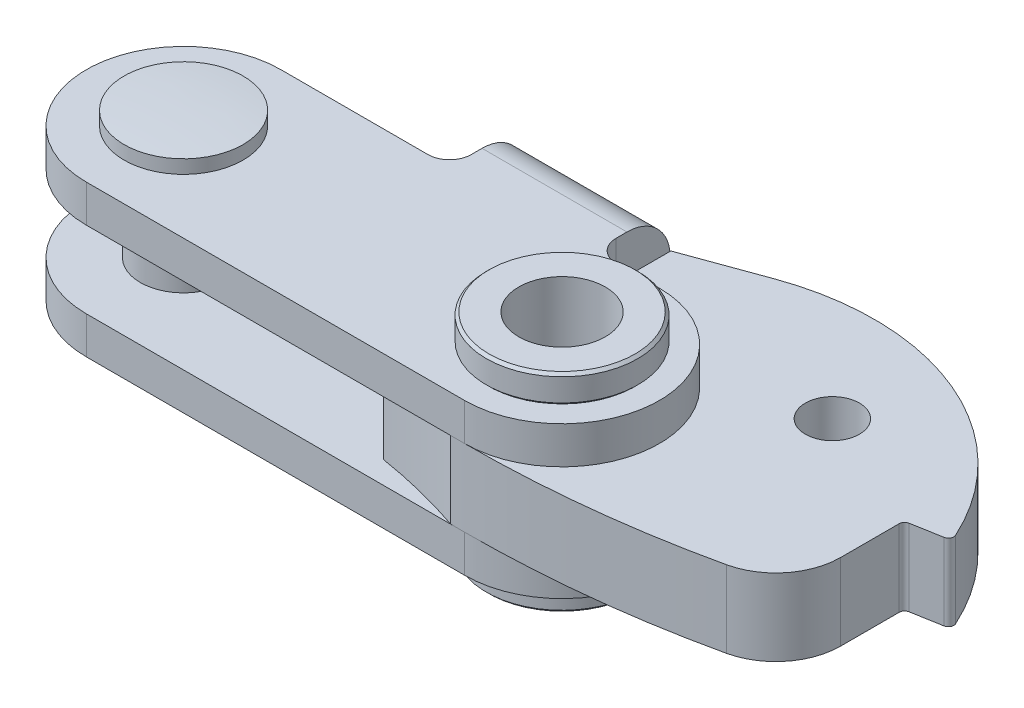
ISO-10303-21;
HEADER;
FILE_DESCRIPTION(('STEP AP214'),'2;1');
FILE_NAME('part.step','',(''),(''),'','','');
FILE_SCHEMA(('AUTOMOTIVE_DESIGN { 1 0 10303 214 1 1 1 1 }'));
ENDSEC;
DATA;
#1=APPLICATION_CONTEXT('core data for automotive mechanical design processes');
#2=APPLICATION_PROTOCOL_DEFINITION('international standard','automotive_design',2000,#1);
#3=PRODUCT_CONTEXT('',#1,'mechanical');
#4=PRODUCT('Part','Part','',(#3));
#5=PRODUCT_RELATED_PRODUCT_CATEGORY('part','',(#4));
#6=PRODUCT_DEFINITION_FORMATION('','',#4);
#7=PRODUCT_DEFINITION_CONTEXT('part definition',#1,'design');
#8=PRODUCT_DEFINITION('design','',#6,#7);
#9=PRODUCT_DEFINITION_SHAPE('','',#8);
#10=(LENGTH_UNIT() NAMED_UNIT(*) SI_UNIT(.MILLI.,.METRE.));
#11=(NAMED_UNIT(*) PLANE_ANGLE_UNIT() SI_UNIT($,.RADIAN.));
#12=(NAMED_UNIT(*) SI_UNIT($,.STERADIAN.) SOLID_ANGLE_UNIT());
#13=UNCERTAINTY_MEASURE_WITH_UNIT(LENGTH_MEASURE(1.E-05),#10,'distance_accuracy_value','');
#14=(GEOMETRIC_REPRESENTATION_CONTEXT(3) GLOBAL_UNCERTAINTY_ASSIGNED_CONTEXT((#13)) GLOBAL_UNIT_ASSIGNED_CONTEXT((#10,
#11,#12)) REPRESENTATION_CONTEXT('',''));
#15=CARTESIAN_POINT('',(0.,0.,0.));
#16=DIRECTION('',(0.,0.,1.));
#17=DIRECTION('',(1.,0.,0.));
#18=AXIS2_PLACEMENT_3D('',#15,#16,#17);
#19=CARTESIAN_POINT('',(35.,-9.7,0.));
#20=DIRECTION('',(0.,1.,0.));
#21=DIRECTION('',(0.,0.,-1.));
#22=AXIS2_PLACEMENT_3D('',#19,#20,#21);
#23=CYLINDRICAL_SURFACE('',#22,4.);
#24=CARTESIAN_POINT('',(35.,-9.6,0.));
#25=DIRECTION('',(0.,-1.,0.));
#26=DIRECTION('',(0.,0.,-1.));
#27=AXIS2_PLACEMENT_3D('',#24,#25,#26);
#28=CIRCLE('',#27,4.);
#29=CARTESIAN_POINT('',(35.,-9.6,-4.));
#30=VERTEX_POINT('',#29);
#31=EDGE_CURVE('E1712',#30,#30,#28,.T.);
#32=ORIENTED_EDGE('',*,*,#31,.T.);
#33=EDGE_LOOP('',(#32));
#34=FACE_BOUND('',#33,.T.);
#35=CARTESIAN_POINT('',(35.,9.6,0.));
#36=DIRECTION('',(0.,1.,0.));
#37=DIRECTION('',(0.,0.,1.));
#38=AXIS2_PLACEMENT_3D('',#35,#36,#37);
#39=CIRCLE('',#38,4.);
#40=CARTESIAN_POINT('',(35.,9.6,4.));
#41=VERTEX_POINT('',#40);
#42=EDGE_CURVE('E1714',#41,#41,#39,.T.);
#43=ORIENTED_EDGE('',*,*,#42,.T.);
#44=EDGE_LOOP('',(#43));
#45=FACE_BOUND('',#44,.T.);
#46=ADVANCED_FACE('F14',(#34,#45),#23,.F.);
#47=CARTESIAN_POINT('',(13.5999999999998,-7.,-11.0000000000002));
#48=DIRECTION('',(0.,1.,0.));
#49=DIRECTION('',(0.,0.,1.));
#50=AXIS2_PLACEMENT_3D('',#47,#48,#49);
#51=CYLINDRICAL_SURFACE('',#50,2.00000000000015);
#52=DIRECTION('',(0.,1.,0.));
#53=VECTOR('',#52,1.);
#54=CARTESIAN_POINT('',(15.6,-7.,-11.));
#55=LINE('',#54,#53);
#56=CARTESIAN_POINT('',(15.6,3.55,-11.0000000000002));
#57=VERTEX_POINT('',#56);
#58=CARTESIAN_POINT('',(15.6,7.,-11.));
#59=VERTEX_POINT('',#58);
#60=EDGE_CURVE('E333',#57,#59,#55,.T.);
#61=ORIENTED_EDGE('',*,*,#60,.F.);
#62=CARTESIAN_POINT('',(13.5999999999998,3.55,-11.0000000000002));
#63=DIRECTION('',(0.,1.,0.));
#64=DIRECTION('',(1.,0.,0.));
#65=AXIS2_PLACEMENT_3D('',#62,#63,#64);
#66=CIRCLE('',#65,2.00000000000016);
#67=CARTESIAN_POINT('',(13.5999999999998,3.55,-9.));
#68=VERTEX_POINT('',#67);
#69=EDGE_CURVE('E1527',#68,#57,#66,.T.);
#70=ORIENTED_EDGE('',*,*,#69,.F.);
#71=DIRECTION('',(0.,1.,0.));
#72=VECTOR('',#71,1.);
#73=CARTESIAN_POINT('',(13.5999999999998,-7.,-9.));
#74=LINE('',#73,#72);
#75=CARTESIAN_POINT('',(13.5999999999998,7.,-9.));
#76=VERTEX_POINT('',#75);
#77=EDGE_CURVE('E329',#68,#76,#74,.T.);
#78=ORIENTED_EDGE('',*,*,#77,.T.);
#79=CARTESIAN_POINT('',(13.5999999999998,7.,-11.0000000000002));
#80=DIRECTION('',(0.,-1.,0.));
#81=DIRECTION('',(0.,0.,-1.));
#82=AXIS2_PLACEMENT_3D('',#79,#80,#81);
#83=CIRCLE('',#82,2.00000000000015);
#84=EDGE_CURVE('E1471',#59,#76,#83,.T.);
#85=ORIENTED_EDGE('',*,*,#84,.F.);
#86=EDGE_LOOP('',(#61,#70,#78,#85));
#87=FACE_BOUND('',#86,.T.);
#88=ADVANCED_FACE('F392',(#87),#51,.F.);
#89=CARTESIAN_POINT('',(13.6,-7.,-9.));
#90=DIRECTION('',(0.,0.,-1.));
#91=DIRECTION('',(0.,1.,0.));
#92=AXIS2_PLACEMENT_3D('',#89,#90,#91);
#93=PLANE('',#92);
#94=ORIENTED_EDGE('',*,*,#77,.F.);
#95=DIRECTION('',(1.,0.,0.));
#96=VECTOR('',#95,1.);
#97=CARTESIAN_POINT('',(0.,3.55,-9.));
#98=LINE('',#97,#96);
#99=CARTESIAN_POINT('',(0.,3.55,-9.));
#100=VERTEX_POINT('',#99);
#101=EDGE_CURVE('E1529',#100,#68,#98,.T.);
#102=ORIENTED_EDGE('',*,*,#101,.F.);
#103=DIRECTION('',(0.,1.,0.));
#104=VECTOR('',#103,1.);
#105=CARTESIAN_POINT('',(0.,-7.,-9.));
#106=LINE('',#105,#104);
#107=CARTESIAN_POINT('',(0.,7.,-9.));
#108=VERTEX_POINT('',#107);
#109=EDGE_CURVE('E325',#100,#108,#106,.T.);
#110=ORIENTED_EDGE('',*,*,#109,.T.);
#111=DIRECTION('',(-1.,0.,0.));
#112=VECTOR('',#111,1.);
#113=CARTESIAN_POINT('',(13.6,7.,-9.));
#114=LINE('',#113,#112);
#115=EDGE_CURVE('E1474',#76,#108,#114,.T.);
#116=ORIENTED_EDGE('',*,*,#115,.F.);
#117=EDGE_LOOP('',(#94,#102,#110,#116));
#118=FACE_BOUND('',#117,.T.);
#119=ADVANCED_FACE('F399',(#118),#93,.T.);
#120=CARTESIAN_POINT('',(0.,-7.,0.));
#121=DIRECTION('',(0.,1.,0.));
#122=DIRECTION('',(0.,0.,1.));
#123=AXIS2_PLACEMENT_3D('',#120,#121,#122);
#124=CYLINDRICAL_SURFACE('',#123,9.);
#125=ORIENTED_EDGE('',*,*,#109,.F.);
#126=CARTESIAN_POINT('',(0.,3.55,0.));
#127=DIRECTION('',(0.,-1.,0.));
#128=DIRECTION('',(1.,0.,0.));
#129=AXIS2_PLACEMENT_3D('',#126,#127,#128);
#130=CIRCLE('',#129,9.);
#131=CARTESIAN_POINT('',(0.,3.55,9.));
#132=VERTEX_POINT('',#131);
#133=EDGE_CURVE('E1535',#132,#100,#130,.T.);
#134=ORIENTED_EDGE('',*,*,#133,.F.);
#135=DIRECTION('',(0.,1.,0.));
#136=VECTOR('',#135,1.);
#137=CARTESIAN_POINT('',(0.,-7.,9.));
#138=LINE('',#137,#136);
#139=CARTESIAN_POINT('',(0.,7.,9.));
#140=VERTEX_POINT('',#139);
#141=EDGE_CURVE('E321',#132,#140,#138,.T.);
#142=ORIENTED_EDGE('',*,*,#141,.T.);
#143=CARTESIAN_POINT('',(0.,7.,0.));
#144=DIRECTION('',(0.,1.,0.));
#145=DIRECTION('',(0.,0.,-1.));
#146=AXIS2_PLACEMENT_3D('',#143,#144,#145);
#147=CIRCLE('',#146,9.);
#148=EDGE_CURVE('E1477',#108,#140,#147,.T.);
#149=ORIENTED_EDGE('',*,*,#148,.F.);
#150=EDGE_LOOP('',(#125,#134,#142,#149));
#151=FACE_BOUND('',#150,.T.);
#152=ADVANCED_FACE('F464',(#151),#124,.T.);
#153=CARTESIAN_POINT('',(0.,-7.,9.));
#154=DIRECTION('',(0.,0.,1.));
#155=DIRECTION('',(0.,-1.,0.));
#156=AXIS2_PLACEMENT_3D('',#153,#154,#155);
#157=PLANE('',#156);
#158=ORIENTED_EDGE('',*,*,#141,.F.);
#159=DIRECTION('',(-1.,0.,0.));
#160=VECTOR('',#159,1.);
#161=CARTESIAN_POINT('',(35.,3.55,9.));
#162=LINE('',#161,#160);
#163=CARTESIAN_POINT('',(35.,3.55,9.));
#164=VERTEX_POINT('',#163);
#165=EDGE_CURVE('E1537',#164,#132,#162,.T.);
#166=ORIENTED_EDGE('',*,*,#165,.F.);
#167=DIRECTION('',(0.,1.,0.));
#168=VECTOR('',#167,1.);
#169=CARTESIAN_POINT('',(35.,-7.,9.));
#170=LINE('',#169,#168);
#171=CARTESIAN_POINT('',(35.,7.,9.));
#172=VERTEX_POINT('',#171);
#173=EDGE_CURVE('E317',#164,#172,#170,.T.);
#174=ORIENTED_EDGE('',*,*,#173,.T.);
#175=DIRECTION('',(1.,0.,0.));
#176=VECTOR('',#175,1.);
#177=CARTESIAN_POINT('',(0.,7.,9.));
#178=LINE('',#177,#176);
#179=EDGE_CURVE('E1480',#140,#172,#178,.T.);
#180=ORIENTED_EDGE('',*,*,#179,.F.);
#181=EDGE_LOOP('',(#158,#166,#174,#180));
#182=FACE_BOUND('',#181,.T.);
#183=ADVANCED_FACE('F460',(#182),#157,.T.);
#184=CARTESIAN_POINT('',(0.,-7.,9.));
#185=VERTEX_POINT('',#184);
#186=CARTESIAN_POINT('',(0.,-3.55,9.));
#187=VERTEX_POINT('',#186);
#188=EDGE_CURVE('E322',#185,#187,#138,.T.);
#189=ORIENTED_EDGE('',*,*,#188,.T.);
#190=CARTESIAN_POINT('',(0.,-3.55,0.));
#191=DIRECTION('',(0.,1.,0.));
#192=DIRECTION('',(0.,0.,1.));
#193=AXIS2_PLACEMENT_3D('',#190,#191,#192);
#194=CIRCLE('',#193,9.);
#195=CARTESIAN_POINT('',(0.,-3.55,-9.));
#196=VERTEX_POINT('',#195);
#197=EDGE_CURVE('E1361',#196,#187,#194,.T.);
#198=ORIENTED_EDGE('',*,*,#197,.F.);
#199=CARTESIAN_POINT('',(0.,-7.,-9.));
#200=VERTEX_POINT('',#199);
#201=EDGE_CURVE('E326',#200,#196,#106,.T.);
#202=ORIENTED_EDGE('',*,*,#201,.F.);
#203=CARTESIAN_POINT('',(0.,-7.,0.));
#204=DIRECTION('',(0.,1.,0.));
#205=DIRECTION('',(0.,0.,-1.));
#206=AXIS2_PLACEMENT_3D('',#203,#204,#205);
#207=CIRCLE('',#206,9.);
#208=EDGE_CURVE('E1363',#200,#185,#207,.T.);
#209=ORIENTED_EDGE('',*,*,#208,.T.);
#210=EDGE_LOOP('',(#189,#198,#202,#209));
#211=FACE_BOUND('',#210,.T.);
#212=ADVANCED_FACE('F463',(#211),#124,.T.);
#213=ORIENTED_EDGE('',*,*,#201,.T.);
#214=DIRECTION('',(-1.,0.,0.));
#215=VECTOR('',#214,1.);
#216=CARTESIAN_POINT('',(13.5999999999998,-3.55,-9.));
#217=LINE('',#216,#215);
#218=CARTESIAN_POINT('',(13.5999999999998,-3.55,-9.));
#219=VERTEX_POINT('',#218);
#220=EDGE_CURVE('E1376',#219,#196,#217,.T.);
#221=ORIENTED_EDGE('',*,*,#220,.F.);
#222=CARTESIAN_POINT('',(13.5999999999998,-7.,-9.));
#223=VERTEX_POINT('',#222);
#224=EDGE_CURVE('E330',#223,#219,#74,.T.);
#225=ORIENTED_EDGE('',*,*,#224,.F.);
#226=DIRECTION('',(-1.,0.,0.));
#227=VECTOR('',#226,1.);
#228=CARTESIAN_POINT('',(13.6,-7.,-9.));
#229=LINE('',#228,#227);
#230=EDGE_CURVE('E1500',#223,#200,#229,.T.);
#231=ORIENTED_EDGE('',*,*,#230,.T.);
#232=EDGE_LOOP('',(#213,#221,#225,#231));
#233=FACE_BOUND('',#232,.T.);
#234=ADVANCED_FACE('F472',(#233),#93,.T.);
#235=ORIENTED_EDGE('',*,*,#224,.T.);
#236=CARTESIAN_POINT('',(13.5999999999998,-3.55,-11.0000000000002));
#237=DIRECTION('',(0.,-1.,0.));
#238=DIRECTION('',(0.,0.,1.));
#239=AXIS2_PLACEMENT_3D('',#236,#237,#238);
#240=CIRCLE('',#239,2.00000000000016);
#241=CARTESIAN_POINT('',(15.6,-3.55,-11.));
#242=VERTEX_POINT('',#241);
#243=EDGE_CURVE('E1613',#242,#219,#240,.T.);
#244=ORIENTED_EDGE('',*,*,#243,.F.);
#245=CARTESIAN_POINT('',(15.6,-7.,-11.));
#246=VERTEX_POINT('',#245);
#247=EDGE_CURVE('E334',#246,#242,#55,.T.);
#248=ORIENTED_EDGE('',*,*,#247,.F.);
#249=CARTESIAN_POINT('',(13.5999999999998,-7.,-11.0000000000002));
#250=DIRECTION('',(0.,-1.,0.));
#251=DIRECTION('',(0.,0.,-1.));
#252=AXIS2_PLACEMENT_3D('',#249,#250,#251);
#253=CIRCLE('',#252,2.00000000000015);
#254=EDGE_CURVE('E1497',#246,#223,#253,.T.);
#255=ORIENTED_EDGE('',*,*,#254,.T.);
#256=EDGE_LOOP('',(#235,#244,#248,#255));
#257=FACE_BOUND('',#256,.T.);
#258=ADVANCED_FACE('F402',(#257),#51,.F.);
#259=CARTESIAN_POINT('',(35.,-7.,9.));
#260=VERTEX_POINT('',#259);
#261=CARTESIAN_POINT('',(35.,-3.55,9.));
#262=VERTEX_POINT('',#261);
#263=EDGE_CURVE('E318',#260,#262,#170,.T.);
#264=ORIENTED_EDGE('',*,*,#263,.T.);
#265=DIRECTION('',(1.,0.,0.));
#266=VECTOR('',#265,1.);
#267=CARTESIAN_POINT('',(0.,-3.55,9.));
#268=LINE('',#267,#266);
#269=EDGE_CURVE('E1370',#187,#262,#268,.T.);
#270=ORIENTED_EDGE('',*,*,#269,.F.);
#271=ORIENTED_EDGE('',*,*,#188,.F.);
#272=DIRECTION('',(1.,0.,0.));
#273=VECTOR('',#272,1.);
#274=CARTESIAN_POINT('',(0.,-7.,9.));
#275=LINE('',#274,#273);
#276=EDGE_CURVE('E1367',#185,#260,#275,.T.);
#277=ORIENTED_EDGE('',*,*,#276,.T.);
#278=EDGE_LOOP('',(#264,#270,#271,#277));
#279=FACE_BOUND('',#278,.T.);
#280=ADVANCED_FACE('F466',(#279),#157,.T.);
#281=CARTESIAN_POINT('',(17.,0.,-1.5));
#282=DIRECTION('',(0.707106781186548,0.,-0.707106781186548));
#283=DIRECTION('',(-0.707106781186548,0.,-0.707106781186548));
#284=AXIS2_PLACEMENT_3D('',#281,#282,#283);
#285=PLANE('',#284);
#286=DIRECTION('',(0.,-1.,0.));
#287=VECTOR('',#286,1.);
#288=CARTESIAN_POINT('',(17.,0.,-1.5));
#289=LINE('',#288,#287);
#290=CARTESIAN_POINT('',(17.,3.55,-1.5));
#291=VERTEX_POINT('',#290);
#292=CARTESIAN_POINT('',(17.,-3.55,-1.5));
#293=VERTEX_POINT('',#292);
#294=EDGE_CURVE('E1400',#291,#293,#289,.T.);
#295=ORIENTED_EDGE('',*,*,#294,.T.);
#296=DIRECTION('',(-0.707106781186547,0.,-0.707106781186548));
#297=VECTOR('',#296,1.);
#298=CARTESIAN_POINT('',(25.4334003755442,-3.55,6.9334003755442));
#299=LINE('',#298,#297);
#300=CARTESIAN_POINT('',(25.4334003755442,-3.55,6.9334003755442));
#301=VERTEX_POINT('',#300);
#302=EDGE_CURVE('E1602',#301,#293,#299,.T.);
#303=ORIENTED_EDGE('',*,*,#302,.F.);
#304=DIRECTION('',(0.,-1.,0.));
#305=VECTOR('',#304,1.);
#306=CARTESIAN_POINT('',(25.4334003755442,0.,6.9334003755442));
#307=LINE('',#306,#305);
#308=CARTESIAN_POINT('',(25.4334003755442,3.55,6.9334003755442));
#309=VERTEX_POINT('',#308);
#310=EDGE_CURVE('E1398',#309,#301,#307,.T.);
#311=ORIENTED_EDGE('',*,*,#310,.F.);
#312=DIRECTION('',(0.707106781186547,0.,0.707106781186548));
#313=VECTOR('',#312,1.);
#314=CARTESIAN_POINT('',(17.,3.55,-1.5));
#315=LINE('',#314,#313);
#316=EDGE_CURVE('E1579',#291,#309,#315,.T.);
#317=ORIENTED_EDGE('',*,*,#316,.F.);
#318=EDGE_LOOP('',(#295,#303,#311,#317));
#319=FACE_BOUND('',#318,.T.);
#320=ADVANCED_FACE('F486',(#319),#285,.F.);
#321=CARTESIAN_POINT('',(17.5000000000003,0.,56.299999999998));
#322=DIRECTION('',(0.,-1.,0.));
#323=DIRECTION('',(0.,0.,-1.));
#324=AXIS2_PLACEMENT_3D('',#321,#322,#323);
#325=CYLINDRICAL_SURFACE('',#324,49.999999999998);
#326=ORIENTED_EDGE('',*,*,#310,.T.);
#327=CARTESIAN_POINT('',(17.5000000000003,-3.55,56.299999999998));
#328=DIRECTION('',(0.,1.,0.));
#329=DIRECTION('',(0.,0.,1.));
#330=AXIS2_PLACEMENT_3D('',#327,#328,#329);
#331=CIRCLE('',#330,49.999999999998);
#332=CARTESIAN_POINT('',(33.6829995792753,-3.55,8.99132717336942));
#333=VERTEX_POINT('',#332);
#334=EDGE_CURVE('E1599',#333,#301,#331,.T.);
#335=ORIENTED_EDGE('',*,*,#334,.F.);
#336=DIRECTION('',(0.,-1.,0.));
#337=VECTOR('',#336,1.);
#338=CARTESIAN_POINT('',(33.6829995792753,0.,8.99132717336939));
#339=LINE('',#338,#337);
#340=CARTESIAN_POINT('',(33.6829995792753,3.55,8.99132717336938));
#341=VERTEX_POINT('',#340);
#342=EDGE_CURVE('E136',#341,#333,#339,.T.);
#343=ORIENTED_EDGE('',*,*,#342,.F.);
#344=CARTESIAN_POINT('',(17.5000000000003,3.55,56.299999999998));
#345=DIRECTION('',(0.,-1.,0.));
#346=DIRECTION('',(1.,0.,0.));
#347=AXIS2_PLACEMENT_3D('',#344,#345,#346);
#348=CIRCLE('',#347,49.999999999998);
#349=EDGE_CURVE('E1582',#309,#341,#348,.T.);
#350=ORIENTED_EDGE('',*,*,#349,.F.);
#351=EDGE_LOOP('',(#326,#335,#343,#350));
#352=FACE_BOUND('',#351,.T.);
#353=ADVANCED_FACE('F549',(#352),#325,.F.);
#354=CARTESIAN_POINT('',(17.,0.,-12.));
#355=DIRECTION('',(1.,0.,0.));
#356=DIRECTION('',(0.,1.,0.));
#357=AXIS2_PLACEMENT_3D('',#354,#355,#356);
#358=PLANE('',#357);
#359=DIRECTION('',(0.,-1.,0.));
#360=VECTOR('',#359,1.);
#361=CARTESIAN_POINT('',(17.,0.,-12.));
#362=LINE('',#361,#360);
#363=CARTESIAN_POINT('',(17.,3.5,-12.));
#364=VERTEX_POINT('',#363);
#365=CARTESIAN_POINT('',(17.,-3.5,-12.));
#366=VERTEX_POINT('',#365);
#367=EDGE_CURVE('E1402',#364,#366,#362,.T.);
#368=ORIENTED_EDGE('',*,*,#367,.T.);
#369=DIRECTION('',(0.,1.,0.));
#370=VECTOR('',#369,1.);
#371=CARTESIAN_POINT('',(17.,-3.55,-12.));
#372=LINE('',#371,#370);
#373=CARTESIAN_POINT('',(17.,-3.55,-12.));
#374=VERTEX_POINT('',#373);
#375=EDGE_CURVE('E38',#374,#366,#372,.T.);
#376=ORIENTED_EDGE('',*,*,#375,.F.);
#377=DIRECTION('',(0.,0.,-1.));
#378=VECTOR('',#377,1.);
#379=CARTESIAN_POINT('',(17.,-3.55,-1.5));
#380=LINE('',#379,#378);
#381=EDGE_CURVE('E1605',#293,#374,#380,.T.);
#382=ORIENTED_EDGE('',*,*,#381,.F.);
#383=ORIENTED_EDGE('',*,*,#294,.F.);
#384=DIRECTION('',(0.,0.,1.));
#385=VECTOR('',#384,1.);
#386=CARTESIAN_POINT('',(17.,3.55,-12.));
#387=LINE('',#386,#385);
#388=CARTESIAN_POINT('',(17.,3.55,-12.));
#389=VERTEX_POINT('',#388);
#390=EDGE_CURVE('E1576',#389,#291,#387,.T.);
#391=ORIENTED_EDGE('',*,*,#390,.F.);
#392=DIRECTION('',(0.,-1.,0.));
#393=VECTOR('',#392,1.);
#394=CARTESIAN_POINT('',(17.,3.55,-12.));
#395=LINE('',#394,#393);
#396=EDGE_CURVE('E1593',#389,#364,#395,.T.);
#397=ORIENTED_EDGE('',*,*,#396,.T.);
#398=EDGE_LOOP('',(#368,#376,#382,#383,#391,#397));
#399=FACE_BOUND('',#398,.T.);
#400=ADVANCED_FACE('F546',(#399),#358,.F.);
#401=CARTESIAN_POINT('',(50.,0.,-10.));
#402=DIRECTION('',(0.,-1.,0.));
#403=DIRECTION('',(0.,0.,-1.));
#404=AXIS2_PLACEMENT_3D('',#401,#402,#403);
#405=CYLINDRICAL_SURFACE('',#404,2.5);
#406=CARTESIAN_POINT('',(50.,3.55,-10.));
#407=DIRECTION('',(0.,1.,0.));
#408=DIRECTION('',(0.,0.,1.));
#409=AXIS2_PLACEMENT_3D('',#406,#407,#408);
#410=CIRCLE('',#409,2.5);
#411=CARTESIAN_POINT('',(50.,3.55,-7.5));
#412=VERTEX_POINT('',#411);
#413=EDGE_CURVE('E1632',#412,#412,#410,.T.);
#414=ORIENTED_EDGE('',*,*,#413,.T.);
#415=EDGE_LOOP('',(#414));
#416=FACE_BOUND('',#415,.T.);
#417=CARTESIAN_POINT('',(50.,-3.55,-10.));
#418=DIRECTION('',(0.,-1.,0.));
#419=DIRECTION('',(0.,0.,-1.));
#420=AXIS2_PLACEMENT_3D('',#417,#418,#419);
#421=CIRCLE('',#420,2.5);
#422=CARTESIAN_POINT('',(50.,-3.55,-12.5));
#423=VERTEX_POINT('',#422);
#424=EDGE_CURVE('E290',#423,#423,#421,.T.);
#425=ORIENTED_EDGE('',*,*,#424,.T.);
#426=EDGE_LOOP('',(#425));
#427=FACE_BOUND('',#426,.T.);
#428=ADVANCED_FACE('F545',(#416,#427),#405,.F.);
#429=CARTESIAN_POINT('',(29.1,0.,-12.));
#430=DIRECTION('',(0.,0.,1.));
#431=DIRECTION('',(0.,-1.,0.));
#432=AXIS2_PLACEMENT_3D('',#429,#430,#431);
#433=PLANE('',#432);
#434=DIRECTION('',(0.,-1.,0.));
#435=VECTOR('',#434,1.);
#436=CARTESIAN_POINT('',(29.1,0.,-12.));
#437=LINE('',#436,#435);
#438=CARTESIAN_POINT('',(29.1,3.55,-12.));
#439=VERTEX_POINT('',#438);
#440=CARTESIAN_POINT('',(29.1,-3.55,-12.));
#441=VERTEX_POINT('',#440);
#442=EDGE_CURVE('E1405',#439,#441,#437,.T.);
#443=ORIENTED_EDGE('',*,*,#442,.T.);
#444=DIRECTION('',(1.,0.,0.));
#445=VECTOR('',#444,1.);
#446=CARTESIAN_POINT('',(29.,-3.55,-12.));
#447=LINE('',#446,#445);
#448=CARTESIAN_POINT('',(29.,-3.55,-12.));
#449=VERTEX_POINT('',#448);
#450=EDGE_CURVE('E29',#449,#441,#447,.T.);
#451=ORIENTED_EDGE('',*,*,#450,.F.);
#452=DIRECTION('',(0.,1.,0.));
#453=VECTOR('',#452,1.);
#454=CARTESIAN_POINT('',(29.,-3.55,-12.));
#455=LINE('',#454,#453);
#456=CARTESIAN_POINT('',(29.,-3.5,-12.));
#457=VERTEX_POINT('',#456);
#458=EDGE_CURVE('E298',#449,#457,#455,.T.);
#459=ORIENTED_EDGE('',*,*,#458,.T.);
#460=DIRECTION('',(-1.,0.,0.));
#461=VECTOR('',#460,1.);
#462=CARTESIAN_POINT('',(29.1,-3.5,-12.));
#463=LINE('',#462,#461);
#464=EDGE_CURVE('E1383',#457,#366,#463,.T.);
#465=ORIENTED_EDGE('',*,*,#464,.T.);
#466=ORIENTED_EDGE('',*,*,#367,.F.);
#467=DIRECTION('',(-1.,0.,0.));
#468=VECTOR('',#467,1.);
#469=CARTESIAN_POINT('',(29.1,3.5,-12.));
#470=LINE('',#469,#468);
#471=CARTESIAN_POINT('',(29.,3.5,-12.));
#472=VERTEX_POINT('',#471);
#473=EDGE_CURVE('E1387',#472,#364,#470,.T.);
#474=ORIENTED_EDGE('',*,*,#473,.F.);
#475=DIRECTION('',(0.,-1.,0.));
#476=VECTOR('',#475,1.);
#477=CARTESIAN_POINT('',(29.,3.55,-12.));
#478=LINE('',#477,#476);
#479=CARTESIAN_POINT('',(29.,3.55,-12.));
#480=VERTEX_POINT('',#479);
#481=EDGE_CURVE('E1555',#480,#472,#478,.T.);
#482=ORIENTED_EDGE('',*,*,#481,.F.);
#483=DIRECTION('',(-1.,0.,0.));
#484=VECTOR('',#483,1.);
#485=CARTESIAN_POINT('',(29.1,3.55,-12.));
#486=LINE('',#485,#484);
#487=EDGE_CURVE('E1557',#439,#480,#486,.T.);
#488=ORIENTED_EDGE('',*,*,#487,.F.);
#489=EDGE_LOOP('',(#443,#451,#459,#465,#466,#474,#482,#488));
#490=FACE_BOUND('',#489,.T.);
#491=ADVANCED_FACE('F541',(#490),#433,.F.);
#492=CARTESIAN_POINT('',(29.1,0.,-15.959350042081));
#493=DIRECTION('',(1.,0.,0.));
#494=DIRECTION('',(0.,1.,0.));
#495=AXIS2_PLACEMENT_3D('',#492,#493,#494);
#496=PLANE('',#495);
#497=DIRECTION('',(0.,-1.,0.));
#498=VECTOR('',#497,1.);
#499=CARTESIAN_POINT('',(29.1,0.,-15.959350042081));
#500=LINE('',#499,#498);
#501=CARTESIAN_POINT('',(29.1,3.55,-15.959350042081));
#502=VERTEX_POINT('',#501);
#503=CARTESIAN_POINT('',(29.1,-3.55,-15.959350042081));
#504=VERTEX_POINT('',#503);
#505=EDGE_CURVE('E1407',#502,#504,#500,.T.);
#506=ORIENTED_EDGE('',*,*,#505,.T.);
#507=DIRECTION('',(0.,0.,-1.));
#508=VECTOR('',#507,1.);
#509=CARTESIAN_POINT('',(29.1,-3.55,-12.));
#510=LINE('',#509,#508);
#511=EDGE_CURVE('E1706',#441,#504,#510,.T.);
#512=ORIENTED_EDGE('',*,*,#511,.F.);
#513=ORIENTED_EDGE('',*,*,#442,.F.);
#514=DIRECTION('',(0.,0.,1.));
#515=VECTOR('',#514,1.);
#516=CARTESIAN_POINT('',(29.1,3.55,-15.959350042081));
#517=LINE('',#516,#515);
#518=EDGE_CURVE('E1560',#502,#439,#517,.T.);
#519=ORIENTED_EDGE('',*,*,#518,.F.);
#520=EDGE_LOOP('',(#506,#512,#513,#519));
#521=FACE_BOUND('',#520,.T.);
#522=ADVANCED_FACE('F537',(#521),#496,.F.);
#523=CARTESIAN_POINT('',(36.099334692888,0.,-18.506899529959));
#524=DIRECTION('',(0.342020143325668,0.,0.939692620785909));
#525=DIRECTION('',(0.939692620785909,0.,-0.342020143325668));
#526=AXIS2_PLACEMENT_3D('',#523,#524,#525);
#527=PLANE('',#526);
#528=DIRECTION('',(0.,-1.,0.));
#529=VECTOR('',#528,1.);
#530=CARTESIAN_POINT('',(36.099334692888,0.,-18.506899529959));
#531=LINE('',#530,#529);
#532=CARTESIAN_POINT('',(36.099334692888,3.55,-18.506899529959));
#533=VERTEX_POINT('',#532);
#534=CARTESIAN_POINT('',(36.099334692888,-3.55,-18.506899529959));
#535=VERTEX_POINT('',#534);
#536=EDGE_CURVE('E1409',#533,#535,#531,.T.);
#537=ORIENTED_EDGE('',*,*,#536,.T.);
#538=DIRECTION('',(0.939692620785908,0.,-0.342020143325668));
#539=VECTOR('',#538,1.);
#540=CARTESIAN_POINT('',(29.1,-3.55,-15.959350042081));
#541=LINE('',#540,#539);
#542=EDGE_CURVE('E1703',#504,#535,#541,.T.);
#543=ORIENTED_EDGE('',*,*,#542,.F.);
#544=ORIENTED_EDGE('',*,*,#505,.F.);
#545=DIRECTION('',(-0.939692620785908,0.,0.342020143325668));
#546=VECTOR('',#545,1.);
#547=CARTESIAN_POINT('',(36.099334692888,3.55,-18.506899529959));
#548=LINE('',#547,#546);
#549=EDGE_CURVE('E1656',#533,#502,#548,.T.);
#550=ORIENTED_EDGE('',*,*,#549,.F.);
#551=EDGE_LOOP('',(#537,#543,#544,#550));
#552=FACE_BOUND('',#551,.T.);
#553=ADVANCED_FACE('F533',(#552),#527,.F.);
#554=CARTESIAN_POINT('',(44.0000000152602,0.,3.19999998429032));
#555=DIRECTION('',(0.,-1.,0.));
#556=DIRECTION('',(0.,0.,-1.));
#557=AXIS2_PLACEMENT_3D('',#554,#555,#556);
#558=CYLINDRICAL_SURFACE('',#557,23.0999999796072);
#559=DIRECTION('',(0.,-1.,0.));
#560=VECTOR('',#559,1.);
#561=CARTESIAN_POINT('',(65.030392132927,0.,-6.3568094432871));
#562=LINE('',#561,#560);
#563=CARTESIAN_POINT('',(65.030392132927,3.55,-6.35680944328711));
#564=VERTEX_POINT('',#563);
#565=CARTESIAN_POINT('',(65.030392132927,-3.55,-6.35680944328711));
#566=VERTEX_POINT('',#565);
#567=EDGE_CURVE('E373',#564,#566,#562,.T.);
#568=ORIENTED_EDGE('',*,*,#567,.T.);
#569=CARTESIAN_POINT('',(44.0000000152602,-3.55,3.19999998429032));
#570=DIRECTION('',(0.,-1.,0.));
#571=DIRECTION('',(0.,0.,-1.));
#572=AXIS2_PLACEMENT_3D('',#569,#570,#571);
#573=CIRCLE('',#572,23.0999999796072);
#574=EDGE_CURVE('E1700',#535,#566,#573,.T.);
#575=ORIENTED_EDGE('',*,*,#574,.F.);
#576=ORIENTED_EDGE('',*,*,#536,.F.);
#577=CARTESIAN_POINT('',(44.0000000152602,3.55,3.19999998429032));
#578=DIRECTION('',(0.,1.,0.));
#579=DIRECTION('',(0.,0.,1.));
#580=AXIS2_PLACEMENT_3D('',#577,#578,#579);
#581=CIRCLE('',#580,23.0999999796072);
#582=EDGE_CURVE('E1653',#564,#533,#581,.T.);
#583=ORIENTED_EDGE('',*,*,#582,.F.);
#584=EDGE_LOOP('',(#568,#575,#576,#583));
#585=FACE_BOUND('',#584,.T.);
#586=ADVANCED_FACE('F529',(#585),#558,.T.);
#587=CARTESIAN_POINT('',(64.5751888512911,0.,-6.14995207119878));
#588=DIRECTION('',(0.,-1.,0.));
#589=DIRECTION('',(0.,0.,-1.));
#590=AXIS2_PLACEMENT_3D('',#587,#588,#589);
#591=CYLINDRICAL_SURFACE('',#590,0.49999999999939);
#592=DIRECTION('',(0.,-1.,0.));
#593=VECTOR('',#592,1.);
#594=CARTESIAN_POINT('',(64.662012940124,0.,-5.6575481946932));
#595=LINE('',#594,#593);
#596=CARTESIAN_POINT('',(64.662012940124,3.55,-5.65754819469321));
#597=VERTEX_POINT('',#596);
#598=CARTESIAN_POINT('',(64.662012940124,-3.55,-5.65754819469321));
#599=VERTEX_POINT('',#598);
#600=EDGE_CURVE('E1386',#597,#599,#595,.T.);
#601=ORIENTED_EDGE('',*,*,#600,.T.);
#602=CARTESIAN_POINT('',(64.5751888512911,-3.55,-6.14995207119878));
#603=DIRECTION('',(0.,-1.,0.));
#604=DIRECTION('',(0.,0.,-1.));
#605=AXIS2_PLACEMENT_3D('',#602,#603,#604);
#606=CIRCLE('',#605,0.499999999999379);
#607=EDGE_CURVE('E1696',#566,#599,#606,.T.);
#608=ORIENTED_EDGE('',*,*,#607,.F.);
#609=ORIENTED_EDGE('',*,*,#567,.F.);
#610=CARTESIAN_POINT('',(64.5751888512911,3.55,-6.14995207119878));
#611=DIRECTION('',(0.,1.,0.));
#612=DIRECTION('',(0.,0.,1.));
#613=AXIS2_PLACEMENT_3D('',#610,#611,#612);
#614=CIRCLE('',#613,0.499999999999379);
#615=EDGE_CURVE('E1650',#597,#564,#614,.T.);
#616=ORIENTED_EDGE('',*,*,#615,.F.);
#617=EDGE_LOOP('',(#601,#608,#609,#616));
#618=FACE_BOUND('',#617,.T.);
#619=ADVANCED_FACE('F525',(#618),#591,.T.);
#620=CARTESIAN_POINT('',(61.913175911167,0.,-5.1728540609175));
#621=DIRECTION('',(-0.17364817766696,0.,-0.984807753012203));
#622=DIRECTION('',(-0.984807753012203,0.,0.17364817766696));
#623=AXIS2_PLACEMENT_3D('',#620,#621,#622);
#624=PLANE('',#623);
#625=DIRECTION('',(0.,-1.,0.));
#626=VECTOR('',#625,1.);
#627=CARTESIAN_POINT('',(61.913175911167,0.,-5.1728540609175));
#628=LINE('',#627,#626);
#629=CARTESIAN_POINT('',(61.913175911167,3.55,-5.1728540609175));
#630=VERTEX_POINT('',#629);
#631=CARTESIAN_POINT('',(61.913175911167,-3.55,-5.1728540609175));
#632=VERTEX_POINT('',#631);
#633=EDGE_CURVE('E1389',#630,#632,#628,.T.);
#634=ORIENTED_EDGE('',*,*,#633,.T.);
#635=DIRECTION('',(-0.984807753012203,0.,0.173648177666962));
#636=VECTOR('',#635,1.);
#637=CARTESIAN_POINT('',(64.662012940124,-3.55,-5.65754819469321));
#638=LINE('',#637,#636);
#639=EDGE_CURVE('E1693',#599,#632,#638,.T.);
#640=ORIENTED_EDGE('',*,*,#639,.F.);
#641=ORIENTED_EDGE('',*,*,#600,.F.);
#642=DIRECTION('',(0.984807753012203,0.,-0.173648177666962));
#643=VECTOR('',#642,1.);
#644=CARTESIAN_POINT('',(61.913175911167,3.55,-5.1728540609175));
#645=LINE('',#644,#643);
#646=EDGE_CURVE('E1647',#630,#597,#645,.T.);
#647=ORIENTED_EDGE('',*,*,#646,.F.);
#648=EDGE_LOOP('',(#634,#640,#641,#647));
#649=FACE_BOUND('',#648,.T.);
#650=ADVANCED_FACE('F528',(#649),#624,.F.);
#651=CARTESIAN_POINT('',(62.0000000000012,0.,-4.68045018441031));
#652=DIRECTION('',(0.,-1.,0.));
#653=DIRECTION('',(0.,0.,-1.));
#654=AXIS2_PLACEMENT_3D('',#651,#652,#653);
#655=CYLINDRICAL_SURFACE('',#654,0.500000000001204);
#656=DIRECTION('',(0.,-1.,0.));
#657=VECTOR('',#656,1.);
#658=CARTESIAN_POINT('',(61.5,0.,-4.6804501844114));
#659=LINE('',#658,#657);
#660=CARTESIAN_POINT('',(61.5,3.55,-4.6804501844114));
#661=VERTEX_POINT('',#660);
#662=CARTESIAN_POINT('',(61.5,-3.55,-4.6804501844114));
#663=VERTEX_POINT('',#662);
#664=EDGE_CURVE('E1391',#661,#663,#659,.T.);
#665=ORIENTED_EDGE('',*,*,#664,.T.);
#666=CARTESIAN_POINT('',(62.0000000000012,-3.55,-4.68045018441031));
#667=DIRECTION('',(0.,1.,0.));
#668=DIRECTION('',(0.,0.,-1.));
#669=AXIS2_PLACEMENT_3D('',#666,#667,#668);
#670=CIRCLE('',#669,0.500000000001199);
#671=EDGE_CURVE('E1687',#632,#663,#670,.T.);
#672=ORIENTED_EDGE('',*,*,#671,.F.);
#673=ORIENTED_EDGE('',*,*,#633,.F.);
#674=CARTESIAN_POINT('',(62.0000000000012,3.55,-4.68045018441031));
#675=DIRECTION('',(0.,-1.,0.));
#676=DIRECTION('',(0.,0.,1.));
#677=AXIS2_PLACEMENT_3D('',#674,#675,#676);
#678=CIRCLE('',#677,0.500000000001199);
#679=EDGE_CURVE('E1644',#661,#630,#678,.T.);
#680=ORIENTED_EDGE('',*,*,#679,.F.);
#681=EDGE_LOOP('',(#665,#672,#673,#680));
#682=FACE_BOUND('',#681,.T.);
#683=ADVANCED_FACE('F566',(#682),#655,.F.);
#684=CARTESIAN_POINT('',(61.5,0.,0.7373969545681));
#685=DIRECTION('',(-1.,0.,0.));
#686=DIRECTION('',(0.,-1.,0.));
#687=AXIS2_PLACEMENT_3D('',#684,#685,#686);
#688=PLANE('',#687);
#689=DIRECTION('',(0.,-1.,0.));
#690=VECTOR('',#689,1.);
#691=CARTESIAN_POINT('',(61.5,0.,0.7373969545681));
#692=LINE('',#691,#690);
#693=CARTESIAN_POINT('',(61.5,3.55,0.7373969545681));
#694=VERTEX_POINT('',#693);
#695=CARTESIAN_POINT('',(61.5,-3.55,0.737396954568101));
#696=VERTEX_POINT('',#695);
#697=EDGE_CURVE('E1393',#694,#696,#692,.T.);
#698=ORIENTED_EDGE('',*,*,#697,.T.);
#699=DIRECTION('',(0.,0.,1.));
#700=VECTOR('',#699,1.);
#701=CARTESIAN_POINT('',(61.5,-3.55,-4.6804501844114));
#702=LINE('',#701,#700);
#703=EDGE_CURVE('E1684',#663,#696,#702,.T.);
#704=ORIENTED_EDGE('',*,*,#703,.F.);
#705=ORIENTED_EDGE('',*,*,#664,.F.);
#706=DIRECTION('',(0.,0.,-1.));
#707=VECTOR('',#706,1.);
#708=CARTESIAN_POINT('',(61.5,3.55,0.7373969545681));
#709=LINE('',#708,#707);
#710=EDGE_CURVE('E1641',#694,#661,#709,.T.);
#711=ORIENTED_EDGE('',*,*,#710,.F.);
#712=EDGE_LOOP('',(#698,#704,#705,#711));
#713=FACE_BOUND('',#712,.T.);
#714=ADVANCED_FACE('F562',(#713),#688,.F.);
#715=CARTESIAN_POINT('',(55.4999999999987,0.,0.737396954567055));
#716=DIRECTION('',(0.,-1.,0.));
#717=DIRECTION('',(0.,0.,-1.));
#718=AXIS2_PLACEMENT_3D('',#715,#716,#717);
#719=CYLINDRICAL_SURFACE('',#718,6.00000000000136);
#720=DIRECTION('',(0.,-1.,0.));
#721=VECTOR('',#720,1.);
#722=CARTESIAN_POINT('',(56.808510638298,0.,6.59297548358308));
#723=LINE('',#722,#721);
#724=CARTESIAN_POINT('',(56.808510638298,3.55,6.59297548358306));
#725=VERTEX_POINT('',#724);
#726=CARTESIAN_POINT('',(56.808510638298,-3.55,6.59297548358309));
#727=VERTEX_POINT('',#726);
#728=EDGE_CURVE('E1395',#725,#727,#723,.T.);
#729=ORIENTED_EDGE('',*,*,#728,.T.);
#730=CARTESIAN_POINT('',(55.4999999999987,-3.55,0.737396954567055));
#731=DIRECTION('',(0.,-1.,0.));
#732=DIRECTION('',(0.,0.,-1.));
#733=AXIS2_PLACEMENT_3D('',#730,#731,#732);
#734=CIRCLE('',#733,6.0000000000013);
#735=EDGE_CURVE('E1627',#696,#727,#734,.T.);
#736=ORIENTED_EDGE('',*,*,#735,.F.);
#737=ORIENTED_EDGE('',*,*,#697,.F.);
#738=CARTESIAN_POINT('',(55.4999999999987,3.55,0.737396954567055));
#739=DIRECTION('',(0.,1.,0.));
#740=DIRECTION('',(0.,0.,1.));
#741=AXIS2_PLACEMENT_3D('',#738,#739,#740);
#742=CIRCLE('',#741,6.0000000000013);
#743=EDGE_CURVE('E1638',#725,#694,#742,.T.);
#744=ORIENTED_EDGE('',*,*,#743,.F.);
#745=EDGE_LOOP('',(#729,#736,#737,#744));
#746=FACE_BOUND('',#745,.T.);
#747=ADVANCED_FACE('F559',(#746),#719,.T.);
#748=CARTESIAN_POINT('',(35.,0.,-91.0000000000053));
#749=DIRECTION('',(0.,-1.,0.));
#750=DIRECTION('',(0.,0.,-1.));
#751=AXIS2_PLACEMENT_3D('',#748,#749,#750);
#752=CYLINDRICAL_SURFACE('',#751,100.000000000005);
#753=CARTESIAN_POINT('',(35.,-3.55,-91.0000000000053));
#754=DIRECTION('',(0.,-1.,0.));
#755=DIRECTION('',(0.,0.,-1.));
#756=AXIS2_PLACEMENT_3D('',#753,#754,#755);
#757=CIRCLE('',#756,100.000000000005);
#758=EDGE_CURVE('E1624',#727,#262,#757,.T.);
#759=ORIENTED_EDGE('',*,*,#758,.F.);
#760=ORIENTED_EDGE('',*,*,#728,.F.);
#761=CARTESIAN_POINT('',(35.,3.55,-91.0000000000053));
#762=DIRECTION('',(0.,1.,0.));
#763=DIRECTION('',(0.,0.,1.));
#764=AXIS2_PLACEMENT_3D('',#761,#762,#763);
#765=CIRCLE('',#764,100.000000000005);
#766=EDGE_CURVE('E1635',#164,#725,#765,.T.);
#767=ORIENTED_EDGE('',*,*,#766,.F.);
#768=CARTESIAN_POINT('',(35.,3.55,-91.0000000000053));
#769=DIRECTION('',(0.,1.,0.));
#770=DIRECTION('',(1.,0.,0.));
#771=AXIS2_PLACEMENT_3D('',#768,#769,#770);
#772=CIRCLE('',#771,100.000000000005);
#773=EDGE_CURVE('E1585',#341,#164,#772,.T.);
#774=ORIENTED_EDGE('',*,*,#773,.F.);
#775=ORIENTED_EDGE('',*,*,#342,.T.);
#776=CARTESIAN_POINT('',(35.,-3.55,-91.0000000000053));
#777=DIRECTION('',(0.,-1.,0.));
#778=DIRECTION('',(0.,0.,1.));
#779=AXIS2_PLACEMENT_3D('',#776,#777,#778);
#780=CIRCLE('',#779,100.000000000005);
#781=EDGE_CURVE('E1373',#262,#333,#780,.T.);
#782=ORIENTED_EDGE('',*,*,#781,.F.);
#783=EDGE_LOOP('',(#759,#760,#767,#774,#775,#782));
#784=FACE_BOUND('',#783,.T.);
#785=ADVANCED_FACE('F485',(#784),#752,.T.);
#786=CARTESIAN_POINT('',(0.,-6.,0.));
#787=DIRECTION('',(0.,-1.,0.));
#788=DIRECTION('',(-1.,0.,0.));
#789=AXIS2_PLACEMENT_3D('',#786,#787,#788);
#790=CONICAL_SURFACE('',#789,2.75,1.04719755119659);
#791=CARTESIAN_POINT('',(0.,-4.4122867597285,0.));
#792=VERTEX_POINT('',#791);
#793=VERTEX_LOOP('',#792);
#794=FACE_BOUND('',#793,.T.);
#795=CARTESIAN_POINT('',(0.,-6.,0.));
#796=DIRECTION('',(0.,1.,0.));
#797=DIRECTION('',(1.,0.,0.));
#798=AXIS2_PLACEMENT_3D('',#795,#796,#797);
#799=CIRCLE('',#798,2.75);
#800=CARTESIAN_POINT('',(2.75,-6.,0.));
#801=VERTEX_POINT('',#800);
#802=EDGE_CURVE('E352',#801,#801,#799,.T.);
#803=ORIENTED_EDGE('',*,*,#802,.F.);
#804=EDGE_LOOP('',(#803));
#805=FACE_BOUND('',#804,.T.);
#806=ADVANCED_FACE('F481',(#794,#805),#790,.F.);
#807=CARTESIAN_POINT('',(0.,-4.4122867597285,0.));
#808=DIRECTION('',(0.,1.,0.));
#809=DIRECTION('',(1.,0.,0.));
#810=AXIS2_PLACEMENT_3D('',#807,#808,#809);
#811=CYLINDRICAL_SURFACE('',#810,2.75);
#812=ORIENTED_EDGE('',*,*,#802,.T.);
#813=EDGE_LOOP('',(#812));
#814=FACE_BOUND('',#813,.T.);
#815=CARTESIAN_POINT('',(0.,-8.4369460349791,0.));
#816=DIRECTION('',(0.,1.,0.));
#817=DIRECTION('',(1.,0.,0.));
#818=AXIS2_PLACEMENT_3D('',#815,#816,#817);
#819=CIRCLE('',#818,2.75);
#820=CARTESIAN_POINT('',(-2.74999999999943,-8.4369460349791,0.));
#821=VERTEX_POINT('',#820);
#822=EDGE_CURVE('E355',#821,#821,#819,.T.);
#823=ORIENTED_EDGE('',*,*,#822,.F.);
#824=EDGE_LOOP('',(#823));
#825=FACE_BOUND('',#824,.T.);
#826=ADVANCED_FACE('F484',(#814,#825),#811,.F.);
#827=CARTESIAN_POINT('',(35.,-9.4,0.));
#828=DIRECTION('',(0.,1.,0.));
#829=DIRECTION('',(-0.383049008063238,0.,-0.923728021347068));
#830=AXIS2_PLACEMENT_3D('',#827,#828,#829);
#831=CYLINDRICAL_SURFACE('',#830,7.);
#832=CARTESIAN_POINT('',(35.,-9.35,0.));
#833=DIRECTION('',(0.,-1.,0.));
#834=DIRECTION('',(0.,0.,-1.));
#835=AXIS2_PLACEMENT_3D('',#832,#833,#834);
#836=CIRCLE('',#835,7.);
#837=CARTESIAN_POINT('',(35.,-9.35,-7.));
#838=VERTEX_POINT('',#837);
#839=EDGE_CURVE('E372',#838,#838,#836,.F.);
#840=ORIENTED_EDGE('',*,*,#839,.T.);
#841=EDGE_LOOP('',(#840));
#842=FACE_BOUND('',#841,.T.);
#843=CARTESIAN_POINT('',(35.,-7.2,0.));
#844=DIRECTION('',(0.,1.,0.));
#845=DIRECTION('',(-0.383049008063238,0.,-0.923728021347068));
#846=AXIS2_PLACEMENT_3D('',#843,#844,#845);
#847=CIRCLE('',#846,7.);
#848=CARTESIAN_POINT('',(32.3186569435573,-7.2,-6.46609614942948));
#849=VERTEX_POINT('',#848);
#850=EDGE_CURVE('E1414',#849,#849,#847,.T.);
#851=ORIENTED_EDGE('',*,*,#850,.F.);
#852=EDGE_LOOP('',(#851));
#853=FACE_BOUND('',#852,.T.);
#854=ADVANCED_FACE('F441',(#842,#853),#831,.T.);
#855=CARTESIAN_POINT('',(5.4470038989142E-12,51.5000000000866,0.));
#856=DIRECTION('',(0.,1.,0.));
#857=DIRECTION('',(-1.,0.,0.));
#858=AXIS2_PLACEMENT_3D('',#855,#856,#857);
#859=SPHERICAL_SURFACE('',#858,60.0000000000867);
#860=CARTESIAN_POINT('',(0.,-8.2473848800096,0.));
#861=DIRECTION('',(0.,1.,0.));
#862=DIRECTION('',(1.,0.,0.));
#863=AXIS2_PLACEMENT_3D('',#860,#861,#862);
#864=CIRCLE('',#863,5.5);
#865=CARTESIAN_POINT('',(-5.4999999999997,-8.2473848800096,0.));
#866=VERTEX_POINT('',#865);
#867=EDGE_CURVE('E359',#866,#866,#864,.T.);
#868=CARTESIAN_POINT('',(-2.74999999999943,-8.4369460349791,0.));
#869=CARTESIAN_POINT('',(-2.77868615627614,-8.43562986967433,0.));
#870=CARTESIAN_POINT('',(-2.80737136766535,-8.43429311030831,0.));
#871=CARTESIAN_POINT('',(-2.8647398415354,-8.43157840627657,0.));
#872=CARTESIAN_POINT('',(-2.89342310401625,-8.43020046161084,0.));
#873=CARTESIAN_POINT('',(-2.95078762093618,-8.42740338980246,0.));
#874=CARTESIAN_POINT('',(-2.97946887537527,-8.42598426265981,0.));
#875=CARTESIAN_POINT('',(-3.03682931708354,-8.42310482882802,0.));
#876=CARTESIAN_POINT('',(-3.06550850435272,-8.42164452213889,0.));
#877=CARTESIAN_POINT('',(-3.12286475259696,-8.41868273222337,0.));
#878=CARTESIAN_POINT('',(-3.15154181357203,-8.41718124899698,0.));
#879=CARTESIAN_POINT('',(-3.20889375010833,-8.41413710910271,0.));
#880=CARTESIAN_POINT('',(-3.23756862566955,-8.41259445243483,0.));
#881=CARTESIAN_POINT('',(-3.29491613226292,-8.40946796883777,0.));
#882=CARTESIAN_POINT('',(-3.32358876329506,-8.4078841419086,0.));
#883=CARTESIAN_POINT('',(-3.38093172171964,-8.40467532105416,0.));
#884=CARTESIAN_POINT('',(-3.40960204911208,-8.40305032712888,0.));
#885=CARTESIAN_POINT('',(-3.46694034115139,-8.39975917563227,0.));
#886=CARTESIAN_POINT('',(-3.49560830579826,-8.39809301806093,0.));
#887=CARTESIAN_POINT('',(-3.55294181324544,-8.39471954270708,0.));
#888=CARTESIAN_POINT('',(-3.58160735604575,-8.39301222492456,0.));
#889=CARTESIAN_POINT('',(-3.6389359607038,-8.38955643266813,0.));
#890=CARTESIAN_POINT('',(-3.66759902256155,-8.38780795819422,0.));
#891=CARTESIAN_POINT('',(-3.72492260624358,-8.38426985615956,0.));
#892=CARTESIAN_POINT('',(-3.75358312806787,-8.38248022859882,0.));
#893=CARTESIAN_POINT('',(-3.81090157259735,-8.37885982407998,0.));
#894=CARTESIAN_POINT('',(-3.83955949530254,-8.37702904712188,0.));
#895=CARTESIAN_POINT('',(-3.89687268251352,-8.37332634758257,0.));
#896=CARTESIAN_POINT('',(-3.92552794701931,-8.37145442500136,0.));
#897=CARTESIAN_POINT('',(-3.98283575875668,-8.36766943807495,0.));
#898=CARTESIAN_POINT('',(-4.01148830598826,-8.36575637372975,0.));
#899=CARTESIAN_POINT('',(-4.068790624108,-8.36188910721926,0.));
#900=CARTESIAN_POINT('',(-4.09744039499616,-8.35993490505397,0.));
#901=CARTESIAN_POINT('',(-4.15473710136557,-8.35598536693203,0.));
#902=CARTESIAN_POINT('',(-4.18338403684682,-8.35399003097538,0.));
#903=CARTESIAN_POINT('',(-4.24067501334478,-8.34995822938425,0.));
#904=CARTESIAN_POINT('',(-4.26931905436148,-8.34792176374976,0.));
#905=CARTESIAN_POINT('',(-4.32660418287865,-8.34380770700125,0.));
#906=CARTESIAN_POINT('',(-4.35524527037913,-8.34173011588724,0.));
#907=CARTESIAN_POINT('',(-4.41252443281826,-8.33753381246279,0.));
#908=CARTESIAN_POINT('',(-4.44116250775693,-8.33541510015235,0.));
#909=CARTESIAN_POINT('',(-4.49843558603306,-8.33113655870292,0.));
#910=CARTESIAN_POINT('',(-4.52707058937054,-8.32897672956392,0.));
#911=CARTESIAN_POINT('',(-4.58433746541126,-8.32461595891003,0.));
#912=CARTESIAN_POINT('',(-4.6129693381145,-8.32241501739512,0.));
#913=CARTESIAN_POINT('',(-4.67022989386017,-8.31797202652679,0.));
#914=CARTESIAN_POINT('',(-4.6988585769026,-8.31572997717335,0.));
#915=CARTESIAN_POINT('',(-4.75611269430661,-8.31120477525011,0.));
#916=CARTESIAN_POINT('',(-4.7847381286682,-8.3089216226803,0.));
#917=CARTESIAN_POINT('',(-4.84198568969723,-8.30431421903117,0.));
#918=CARTESIAN_POINT('',(-4.87060781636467,-8.30198996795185,0.));
#919=CARTESIAN_POINT('',(-4.92784870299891,-8.29730037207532,0.));
#920=CARTESIAN_POINT('',(-4.95646746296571,-8.29493502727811,0.));
#921=CARTESIAN_POINT('',(-5.0137015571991,-8.29016324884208,0.));
#922=CARTESIAN_POINT('',(-5.04231689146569,-8.28775681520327,0.));
#923=CARTESIAN_POINT('',(-5.09954407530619,-8.28290286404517,0.));
#924=CARTESIAN_POINT('',(-5.12815592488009,-8.28045534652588,0.));
#925=CARTESIAN_POINT('',(-5.18537608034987,-8.27551923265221,0.));
#926=CARTESIAN_POINT('',(-5.21398438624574,-8.27303063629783,0.));
#927=CARTESIAN_POINT('',(-5.27119739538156,-8.26801236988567,0.));
#928=CARTESIAN_POINT('',(-5.29980209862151,-8.26548269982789,0.));
#929=CARTESIAN_POINT('',(-5.35700784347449,-8.26038229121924,0.));
#930=CARTESIAN_POINT('',(-5.38560888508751,-8.25781155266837,0.));
#931=CARTESIAN_POINT('',(-5.44280724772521,-8.25262901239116,0.));
#932=CARTESIAN_POINT('',(-5.47140456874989,-8.25001721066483,0.));
#933=CARTESIAN_POINT('',(-5.4999999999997,-8.2473848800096,0.));
#934=B_SPLINE_CURVE_WITH_KNOTS('',3,(#868,#869,#870,#871,#872,#873,#874,#875,#876,#877,#878,
#879,#880,#881,#882,#883,#884,#885,#886,#887,#888,#889,#890,#891,#892,#893,#894,#895,#896,#897,
#898,#899,#900,#901,#902,#903,#904,#905,#906,#907,#908,#909,#910,#911,#912,#913,#914,#915,#916,
#917,#918,#919,#920,#921,#922,#923,#924,#925,#926,#927,#928,#929,#930,#931,#932,#933),
.UNSPECIFIED.,.F.,.F.,(4,2,2,2,2,2,2,2,2,2,2,2,2,2,2,2,2,2,2,2,2,2,2,2,2,2,2,2,2,2,2,2,4),(0.,
0.086148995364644,0.172297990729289,0.258446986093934,0.344595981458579,0.430744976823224,
0.516893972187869,0.603042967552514,0.689191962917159,0.775340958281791,0.861489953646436,
0.947638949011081,1.03378794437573,1.11993693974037,1.20608593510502,1.29223493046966,
1.3783839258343,1.46453292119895,1.5506819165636,1.63683091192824,1.72297990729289,
1.80912890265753,1.89527789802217,1.98142689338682,2.06757588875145,2.1537248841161,
2.23987387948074,2.32602287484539,2.41217187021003,2.49832086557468,2.58446986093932,
2.67061885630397,2.75676785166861),.UNSPECIFIED.);
#935=EDGE_CURVE('BSEAM448',#821,#866,#934,.T.);
#936=ORIENTED_EDGE('',*,*,#822,.T.);
#937=ORIENTED_EDGE('',*,*,#867,.F.);
#938=ORIENTED_EDGE('',*,*,#935,.T.);
#939=ORIENTED_EDGE('',*,*,#935,.F.);
#940=EDGE_LOOP('',(#936,#938,#937,#939));
#941=FACE_BOUND('',#940,.T.);
#942=ADVANCED_FACE('F448',(#941),#859,.T.);
#943=CARTESIAN_POINT('',(35.,-9.7,0.));
#944=DIRECTION('',(0.,1.,0.));
#945=DIRECTION('',(0.,0.,-1.));
#946=AXIS2_PLACEMENT_3D('',#943,#944,#945);
#947=CYLINDRICAL_SURFACE('',#946,7.);
#948=CARTESIAN_POINT('',(35.,9.35,0.));
#949=DIRECTION('',(0.,1.,0.));
#950=DIRECTION('',(0.,0.,1.));
#951=AXIS2_PLACEMENT_3D('',#948,#949,#950);
#952=CIRCLE('',#951,7.);
#953=CARTESIAN_POINT('',(35.,9.35,7.));
#954=VERTEX_POINT('',#953);
#955=EDGE_CURVE('E9',#954,#954,#952,.F.);
#956=ORIENTED_EDGE('',*,*,#955,.T.);
#957=EDGE_LOOP('',(#956));
#958=FACE_BOUND('',#957,.T.);
#959=CARTESIAN_POINT('',(35.,7.25,0.));
#960=DIRECTION('',(0.,1.,0.));
#961=DIRECTION('',(0.,0.,-1.));
#962=AXIS2_PLACEMENT_3D('',#959,#960,#961);
#963=CIRCLE('',#962,7.);
#964=CARTESIAN_POINT('',(35.,7.25,-7.));
#965=VERTEX_POINT('',#964);
#966=EDGE_CURVE('E365',#965,#965,#963,.T.);
#967=ORIENTED_EDGE('',*,*,#966,.T.);
#968=EDGE_LOOP('',(#967));
#969=FACE_BOUND('',#968,.T.);
#970=ADVANCED_FACE('F487',(#958,#969),#947,.T.);
#971=CARTESIAN_POINT('',(-2.12412370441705E-12,-51.4999999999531,0.));
#972=DIRECTION('',(0.,1.,0.));
#973=DIRECTION('',(1.,0.,0.));
#974=AXIS2_PLACEMENT_3D('',#971,#972,#973);
#975=SPHERICAL_SURFACE('',#974,59.9999999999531);
#976=CARTESIAN_POINT('',(0.,8.2473848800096,0.));
#977=DIRECTION('',(0.,1.,0.));
#978=DIRECTION('',(1.,0.,0.));
#979=AXIS2_PLACEMENT_3D('',#976,#977,#978);
#980=CIRCLE('',#979,5.5);
#981=CARTESIAN_POINT('',(5.5,8.2473848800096,0.));
#982=VERTEX_POINT('',#981);
#983=EDGE_CURVE('E362',#982,#982,#980,.T.);
#984=ORIENTED_EDGE('',*,*,#983,.T.);
#985=EDGE_LOOP('',(#984));
#986=FACE_BOUND('',#985,.T.);
#987=ADVANCED_FACE('F491',(#986),#975,.T.);
#988=CARTESIAN_POINT('',(35.,-7.2,0.));
#989=DIRECTION('',(0.,-1.,0.));
#990=DIRECTION('',(0.383049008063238,0.,0.923728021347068));
#991=AXIS2_PLACEMENT_3D('',#988,#989,#990);
#992=CONICAL_SURFACE('',#991,7.,0.78539816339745);
#993=CARTESIAN_POINT('',(35.,-7.,0.));
#994=DIRECTION('',(0.,1.,0.));
#995=DIRECTION('',(-0.383049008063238,0.,-0.923728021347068));
#996=AXIS2_PLACEMENT_3D('',#993,#994,#995);
#997=CIRCLE('',#996,6.8);
#998=CARTESIAN_POINT('',(32.39526674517,-7.,-6.28135054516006));
#999=VERTEX_POINT('',#998);
#1000=EDGE_CURVE('E1415',#999,#999,#997,.T.);
#1001=ORIENTED_EDGE('',*,*,#1000,.F.);
#1002=EDGE_LOOP('',(#1001));
#1003=FACE_BOUND('',#1002,.T.);
#1004=ORIENTED_EDGE('',*,*,#850,.T.);
#1005=EDGE_LOOP('',(#1004));
#1006=FACE_BOUND('',#1005,.T.);
#1007=ADVANCED_FACE('F497',(#1003,#1006),#992,.T.);
#1008=CARTESIAN_POINT('',(0.,-4.4122867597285,0.));
#1009=DIRECTION('',(0.,1.,0.));
#1010=DIRECTION('',(1.,0.,0.));
#1011=AXIS2_PLACEMENT_3D('',#1008,#1009,#1010);
#1012=CYLINDRICAL_SURFACE('',#1011,5.5);
#1013=ORIENTED_EDGE('',*,*,#867,.T.);
#1014=EDGE_LOOP('',(#1013));
#1015=FACE_BOUND('',#1014,.T.);
#1016=CARTESIAN_POINT('',(0.,-7.,0.));
#1017=DIRECTION('',(0.,-1.,0.));
#1018=DIRECTION('',(0.,0.,-1.));
#1019=AXIS2_PLACEMENT_3D('',#1016,#1017,#1018);
#1020=CIRCLE('',#1019,5.5);
#1021=CARTESIAN_POINT('',(0.,-7.,-5.5));
#1022=VERTEX_POINT('',#1021);
#1023=EDGE_CURVE('E348',#1022,#1022,#1020,.T.);
#1024=ORIENTED_EDGE('',*,*,#1023,.T.);
#1025=EDGE_LOOP('',(#1024));
#1026=FACE_BOUND('',#1025,.T.);
#1027=ADVANCED_FACE('F437',(#1015,#1026),#1012,.T.);
#1028=CARTESIAN_POINT('',(35.,7.,0.));
#1029=DIRECTION('',(0.,1.,0.));
#1030=DIRECTION('',(0.,0.,-1.));
#1031=AXIS2_PLACEMENT_3D('',#1028,#1029,#1030);
#1032=CONICAL_SURFACE('',#1031,6.75,0.785398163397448);
#1033=ORIENTED_EDGE('',*,*,#966,.F.);
#1034=EDGE_LOOP('',(#1033));
#1035=FACE_BOUND('',#1034,.T.);
#1036=CARTESIAN_POINT('',(35.,7.,0.));
#1037=DIRECTION('',(0.,1.,0.));
#1038=DIRECTION('',(0.,0.,-1.));
#1039=AXIS2_PLACEMENT_3D('',#1036,#1037,#1038);
#1040=CIRCLE('',#1039,6.75);
#1041=CARTESIAN_POINT('',(35.,7.,-6.75));
#1042=VERTEX_POINT('',#1041);
#1043=EDGE_CURVE('E1418',#1042,#1042,#1040,.T.);
#1044=ORIENTED_EDGE('',*,*,#1043,.T.);
#1045=EDGE_LOOP('',(#1044));
#1046=FACE_BOUND('',#1045,.T.);
#1047=ADVANCED_FACE('F407',(#1035,#1046),#1032,.T.);
#1048=CARTESIAN_POINT('',(0.,-4.4122867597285,0.));
#1049=DIRECTION('',(0.,1.,0.));
#1050=DIRECTION('',(1.,0.,0.));
#1051=AXIS2_PLACEMENT_3D('',#1048,#1049,#1050);
#1052=CYLINDRICAL_SURFACE('',#1051,5.5);
#1053=CARTESIAN_POINT('',(0.,7.,0.));
#1054=DIRECTION('',(0.,1.,0.));
#1055=DIRECTION('',(1.,0.,0.));
#1056=AXIS2_PLACEMENT_3D('',#1053,#1054,#1055);
#1057=CIRCLE('',#1056,5.5);
#1058=CARTESIAN_POINT('',(5.5,7.,0.));
#1059=VERTEX_POINT('',#1058);
#1060=EDGE_CURVE('E351',#1059,#1059,#1057,.T.);
#1061=ORIENTED_EDGE('',*,*,#1060,.T.);
#1062=EDGE_LOOP('',(#1061));
#1063=FACE_BOUND('',#1062,.T.);
#1064=ORIENTED_EDGE('',*,*,#983,.F.);
#1065=EDGE_LOOP('',(#1064));
#1066=FACE_BOUND('',#1065,.T.);
#1067=ADVANCED_FACE('F454',(#1063,#1066),#1052,.T.);
#1068=CARTESIAN_POINT('',(35.,-7.,0.));
#1069=DIRECTION('',(0.,1.,0.));
#1070=DIRECTION('',(0.,0.,1.));
#1071=AXIS2_PLACEMENT_3D('',#1068,#1069,#1070);
#1072=CYLINDRICAL_SURFACE('',#1071,9.);
#1073=CARTESIAN_POINT('',(35.,-3.55,0.));
#1074=DIRECTION('',(0.,1.,0.));
#1075=DIRECTION('',(0.,0.,-1.));
#1076=AXIS2_PLACEMENT_3D('',#1073,#1074,#1075);
#1077=CIRCLE('',#1076,9.);
#1078=CARTESIAN_POINT('',(35.,-3.55,-9.));
#1079=VERTEX_POINT('',#1078);
#1080=EDGE_CURVE('E1623',#262,#1079,#1077,.T.);
#1081=ORIENTED_EDGE('',*,*,#1080,.F.);
#1082=ORIENTED_EDGE('',*,*,#263,.F.);
#1083=CARTESIAN_POINT('',(35.,-7.,0.));
#1084=DIRECTION('',(0.,1.,0.));
#1085=DIRECTION('',(0.,0.,1.));
#1086=AXIS2_PLACEMENT_3D('',#1083,#1084,#1085);
#1087=CIRCLE('',#1086,9.);
#1088=CARTESIAN_POINT('',(35.,-7.,-9.));
#1089=VERTEX_POINT('',#1088);
#1090=EDGE_CURVE('E1505',#260,#1089,#1087,.T.);
#1091=ORIENTED_EDGE('',*,*,#1090,.T.);
#1092=DIRECTION('',(0.,1.,0.));
#1093=VECTOR('',#1092,1.);
#1094=CARTESIAN_POINT('',(35.,-7.,-9.));
#1095=LINE('',#1094,#1093);
#1096=EDGE_CURVE('E314',#1089,#1079,#1095,.T.);
#1097=ORIENTED_EDGE('',*,*,#1096,.T.);
#1098=EDGE_LOOP('',(#1081,#1082,#1091,#1097));
#1099=FACE_BOUND('',#1098,.T.);
#1100=ADVANCED_FACE('F459',(#1099),#1072,.T.);
#1101=CARTESIAN_POINT('',(35.,-7.,-9.));
#1102=DIRECTION('',(0.,0.,-1.));
#1103=DIRECTION('',(0.,1.,0.));
#1104=AXIS2_PLACEMENT_3D('',#1101,#1102,#1103);
#1105=PLANE('',#1104);
#1106=DIRECTION('',(-1.,0.,0.));
#1107=VECTOR('',#1106,1.);
#1108=CARTESIAN_POINT('',(35.,-3.55,-9.));
#1109=LINE('',#1108,#1107);
#1110=CARTESIAN_POINT('',(31.,-3.55,-9.));
#1111=VERTEX_POINT('',#1110);
#1112=EDGE_CURVE('E286',#1079,#1111,#1109,.T.);
#1113=ORIENTED_EDGE('',*,*,#1112,.F.);
#1114=ORIENTED_EDGE('',*,*,#1096,.F.);
#1115=DIRECTION('',(-1.,0.,0.));
#1116=VECTOR('',#1115,1.);
#1117=CARTESIAN_POINT('',(35.,-7.,-9.));
#1118=LINE('',#1117,#1116);
#1119=CARTESIAN_POINT('',(31.,-7.,-9.));
#1120=VERTEX_POINT('',#1119);
#1121=EDGE_CURVE('E1508',#1089,#1120,#1118,.T.);
#1122=ORIENTED_EDGE('',*,*,#1121,.T.);
#1123=DIRECTION('',(0.,1.,0.));
#1124=VECTOR('',#1123,1.);
#1125=CARTESIAN_POINT('',(31.,-7.,-9.));
#1126=LINE('',#1125,#1124);
#1127=EDGE_CURVE('E307',#1120,#1111,#1126,.T.);
#1128=ORIENTED_EDGE('',*,*,#1127,.T.);
#1129=EDGE_LOOP('',(#1113,#1114,#1122,#1128));
#1130=FACE_BOUND('',#1129,.T.);
#1131=ADVANCED_FACE('F453',(#1130),#1105,.T.);
#1132=CARTESIAN_POINT('',(0.,-4.4122867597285,0.));
#1133=DIRECTION('',(0.,1.,0.));
#1134=DIRECTION('',(1.,0.,0.));
#1135=AXIS2_PLACEMENT_3D('',#1132,#1133,#1134);
#1136=CYLINDRICAL_SURFACE('',#1135,4.);
#1137=CARTESIAN_POINT('',(0.,-3.55,0.));
#1138=DIRECTION('',(0.,1.,0.));
#1139=DIRECTION('',(0.,0.,1.));
#1140=AXIS2_PLACEMENT_3D('',#1137,#1138,#1139);
#1141=CIRCLE('',#1140,4.);
#1142=CARTESIAN_POINT('',(0.,-3.55,4.));
#1143=VERTEX_POINT('',#1142);
#1144=EDGE_CURVE('E1595',#1143,#1143,#1141,.T.);
#1145=ORIENTED_EDGE('',*,*,#1144,.T.);
#1146=EDGE_LOOP('',(#1145));
#1147=FACE_BOUND('',#1146,.T.);
#1148=CARTESIAN_POINT('',(0.,3.55,0.));
#1149=DIRECTION('',(0.,-1.,0.));
#1150=DIRECTION('',(1.,0.,0.));
#1151=AXIS2_PLACEMENT_3D('',#1148,#1149,#1150);
#1152=CIRCLE('',#1151,4.);
#1153=CARTESIAN_POINT('',(4.,3.55,0.));
#1154=VERTEX_POINT('',#1153);
#1155=EDGE_CURVE('E1567',#1154,#1154,#1152,.T.);
#1156=ORIENTED_EDGE('',*,*,#1155,.T.);
#1157=EDGE_LOOP('',(#1156));
#1158=FACE_BOUND('',#1157,.T.);
#1159=ADVANCED_FACE('F476',(#1147,#1158),#1136,.T.);
#1160=CARTESIAN_POINT('',(15.6,-7.,-16.));
#1161=DIRECTION('',(-1.,0.,0.));
#1162=DIRECTION('',(0.,-1.,0.));
#1163=AXIS2_PLACEMENT_3D('',#1160,#1161,#1162);
#1164=PLANE('',#1163);
#1165=DIRECTION('',(0.,-1.,0.));
#1166=VECTOR('',#1165,1.);
#1167=CARTESIAN_POINT('',(15.6,3.55,-12.));
#1168=LINE('',#1167,#1166);
#1169=CARTESIAN_POINT('',(15.6,3.55,-12.));
#1170=VERTEX_POINT('',#1169);
#1171=CARTESIAN_POINT('',(15.6,3.5,-12.));
#1172=VERTEX_POINT('',#1171);
#1173=EDGE_CURVE('E1592',#1170,#1172,#1168,.T.);
#1174=ORIENTED_EDGE('',*,*,#1173,.F.);
#1175=DIRECTION('',(0.,0.,-1.));
#1176=VECTOR('',#1175,1.);
#1177=CARTESIAN_POINT('',(15.6,3.55,-11.0000000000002));
#1178=LINE('',#1177,#1176);
#1179=EDGE_CURVE('E1570',#57,#1170,#1178,.T.);
#1180=ORIENTED_EDGE('',*,*,#1179,.F.);
#1181=ORIENTED_EDGE('',*,*,#60,.T.);
#1182=DIRECTION('',(0.,0.,1.));
#1183=VECTOR('',#1182,1.);
#1184=CARTESIAN_POINT('',(15.6,7.,-16.));
#1185=LINE('',#1184,#1183);
#1186=CARTESIAN_POINT('',(15.6,7.,-12.));
#1187=VERTEX_POINT('',#1186);
#1188=EDGE_CURVE('E1468',#1187,#59,#1185,.T.);
#1189=ORIENTED_EDGE('',*,*,#1188,.F.);
#1190=CARTESIAN_POINT('',(15.6,2.99999999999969,-11.9999999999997));
#1191=DIRECTION('',(-1.,0.,0.));
#1192=DIRECTION('',(0.,0.,1.));
#1193=AXIS2_PLACEMENT_3D('',#1190,#1191,#1192);
#1194=CIRCLE('',#1193,4.00000000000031);
#1195=CARTESIAN_POINT('',(15.6,3.,-16.));
#1196=VERTEX_POINT('',#1195);
#1197=EDGE_CURVE('E368',#1187,#1196,#1194,.T.);
#1198=ORIENTED_EDGE('',*,*,#1197,.T.);
#1199=DIRECTION('',(0.,1.,0.));
#1200=VECTOR('',#1199,1.);
#1201=CARTESIAN_POINT('',(15.6,-7.,-16.));
#1202=LINE('',#1201,#1200);
#1203=CARTESIAN_POINT('',(15.6,-3.,-16.));
#1204=VERTEX_POINT('',#1203);
#1205=EDGE_CURVE('E337',#1204,#1196,#1202,.T.);
#1206=ORIENTED_EDGE('',*,*,#1205,.F.);
#1207=CARTESIAN_POINT('',(15.6,-2.99999999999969,-11.9999999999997));
#1208=DIRECTION('',(-1.,0.,0.));
#1209=DIRECTION('',(0.,0.,1.));
#1210=AXIS2_PLACEMENT_3D('',#1207,#1208,#1209);
#1211=CIRCLE('',#1210,4.00000000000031);
#1212=CARTESIAN_POINT('',(15.6,-7.,-12.));
#1213=VERTEX_POINT('',#1212);
#1214=EDGE_CURVE('E1428',#1204,#1213,#1211,.T.);
#1215=ORIENTED_EDGE('',*,*,#1214,.T.);
#1216=DIRECTION('',(0.,0.,1.));
#1217=VECTOR('',#1216,1.);
#1218=CARTESIAN_POINT('',(15.6,-7.,-16.));
#1219=LINE('',#1218,#1217);
#1220=EDGE_CURVE('E1495',#1213,#246,#1219,.T.);
#1221=ORIENTED_EDGE('',*,*,#1220,.T.);
#1222=ORIENTED_EDGE('',*,*,#247,.T.);
#1223=DIRECTION('',(0.,0.,1.));
#1224=VECTOR('',#1223,1.);
#1225=CARTESIAN_POINT('',(15.6,-3.55,-12.));
#1226=LINE('',#1225,#1224);
#1227=CARTESIAN_POINT('',(15.6,-3.55,-12.));
#1228=VERTEX_POINT('',#1227);
#1229=EDGE_CURVE('E1611',#1228,#242,#1226,.T.);
#1230=ORIENTED_EDGE('',*,*,#1229,.F.);
#1231=DIRECTION('',(0.,1.,0.));
#1232=VECTOR('',#1231,1.);
#1233=CARTESIAN_POINT('',(15.6,-3.55,-12.));
#1234=LINE('',#1233,#1232);
#1235=CARTESIAN_POINT('',(15.6,-3.5,-12.));
#1236=VERTEX_POINT('',#1235);
#1237=EDGE_CURVE('E356',#1228,#1236,#1234,.T.);
#1238=ORIENTED_EDGE('',*,*,#1237,.T.);
#1239=CARTESIAN_POINT('',(15.6,-2.99999999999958,-11.9999999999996));
#1240=DIRECTION('',(-1.,0.,0.));
#1241=DIRECTION('',(0.,-1.,0.));
#1242=AXIS2_PLACEMENT_3D('',#1239,#1240,#1241);
#1243=CIRCLE('',#1242,0.500000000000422);
#1244=CARTESIAN_POINT('',(15.6,-3.,-12.5));
#1245=VERTEX_POINT('',#1244);
#1246=EDGE_CURVE('E1459',#1236,#1245,#1243,.F.);
#1247=ORIENTED_EDGE('',*,*,#1246,.T.);
#1248=DIRECTION('',(0.,1.,0.));
#1249=VECTOR('',#1248,1.);
#1250=CARTESIAN_POINT('',(15.6,-7.,-12.5));
#1251=LINE('',#1250,#1249);
#1252=CARTESIAN_POINT('',(15.6,3.,-12.5));
#1253=VERTEX_POINT('',#1252);
#1254=EDGE_CURVE('E1465',#1245,#1253,#1251,.T.);
#1255=ORIENTED_EDGE('',*,*,#1254,.T.);
#1256=CARTESIAN_POINT('',(15.6,2.99999999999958,-11.9999999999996));
#1257=DIRECTION('',(-1.,0.,0.));
#1258=DIRECTION('',(0.,-1.,0.));
#1259=AXIS2_PLACEMENT_3D('',#1256,#1257,#1258);
#1260=CIRCLE('',#1259,0.500000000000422);
#1261=EDGE_CURVE('E1462',#1253,#1172,#1260,.F.);
#1262=ORIENTED_EDGE('',*,*,#1261,.T.);
#1263=EDGE_LOOP('',(#1174,#1180,#1181,#1189,#1198,#1206,#1215,#1221,#1222,#1230,#1238,#1247,
#1255,#1262));
#1264=FACE_BOUND('',#1263,.T.);
#1265=ADVANCED_FACE('F413',(#1264),#1164,.T.);
#1266=CARTESIAN_POINT('',(31.,-2.99999999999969,-11.9999999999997));
#1267=DIRECTION('',(-1.,0.,0.));
#1268=DIRECTION('',(0.,-1.,0.));
#1269=AXIS2_PLACEMENT_3D('',#1266,#1267,#1268);
#1270=CYLINDRICAL_SURFACE('',#1269,4.00000000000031);
#1271=DIRECTION('',(-1.,0.,0.));
#1272=VECTOR('',#1271,1.);
#1273=CARTESIAN_POINT('',(31.,-7.,-12.));
#1274=LINE('',#1273,#1272);
#1275=CARTESIAN_POINT('',(29.,-7.,-11.9999999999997));
#1276=VERTEX_POINT('',#1275);
#1277=EDGE_CURVE('E1432',#1276,#1213,#1274,.T.);
#1278=ORIENTED_EDGE('',*,*,#1277,.T.);
#1279=ORIENTED_EDGE('',*,*,#1214,.F.);
#1280=DIRECTION('',(-1.,0.,0.));
#1281=VECTOR('',#1280,1.);
#1282=CARTESIAN_POINT('',(31.,-3.,-16.));
#1283=LINE('',#1282,#1281);
#1284=CARTESIAN_POINT('',(29.,-3.,-16.));
#1285=VERTEX_POINT('',#1284);
#1286=EDGE_CURVE('E1434',#1285,#1204,#1283,.T.);
#1287=ORIENTED_EDGE('',*,*,#1286,.F.);
#1288=CARTESIAN_POINT('',(29.,-2.99999999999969,-11.9999999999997));
#1289=DIRECTION('',(1.,0.,0.));
#1290=DIRECTION('',(0.,1.,0.));
#1291=AXIS2_PLACEMENT_3D('',#1288,#1289,#1290);
#1292=CIRCLE('',#1291,4.00000000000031);
#1293=EDGE_CURVE('E1442',#1276,#1285,#1292,.T.);
#1294=ORIENTED_EDGE('',*,*,#1293,.F.);
#1295=EDGE_LOOP('',(#1278,#1279,#1287,#1294));
#1296=FACE_BOUND('',#1295,.T.);
#1297=ADVANCED_FACE('F409',(#1296),#1270,.T.);
#1298=CARTESIAN_POINT('',(13.5999999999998,-7.,-11.0000000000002));
#1299=DIRECTION('',(0.,-1.,0.));
#1300=DIRECTION('',(0.,0.,-1.));
#1301=AXIS2_PLACEMENT_3D('',#1298,#1299,#1300);
#1302=PLANE('',#1301);
#1303=CARTESIAN_POINT('',(31.,-7.,-11.0000000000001));
#1304=DIRECTION('',(0.,-1.,0.));
#1305=DIRECTION('',(0.,0.,1.));
#1306=AXIS2_PLACEMENT_3D('',#1303,#1304,#1305);
#1307=CIRCLE('',#1306,2.00000000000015);
#1308=CARTESIAN_POINT('',(29.,-7.,-11.));
#1309=VERTEX_POINT('',#1308);
#1310=EDGE_CURVE('E302',#1120,#1309,#1307,.T.);
#1311=ORIENTED_EDGE('',*,*,#1310,.F.);
#1312=ORIENTED_EDGE('',*,*,#1121,.F.);
#1313=ORIENTED_EDGE('',*,*,#1090,.F.);
#1314=ORIENTED_EDGE('',*,*,#276,.F.);
#1315=ORIENTED_EDGE('',*,*,#208,.F.);
#1316=ORIENTED_EDGE('',*,*,#230,.F.);
#1317=ORIENTED_EDGE('',*,*,#254,.F.);
#1318=ORIENTED_EDGE('',*,*,#1220,.F.);
#1319=ORIENTED_EDGE('',*,*,#1277,.F.);
#1320=DIRECTION('',(0.,0.,-1.));
#1321=VECTOR('',#1320,1.);
#1322=CARTESIAN_POINT('',(29.,-7.,-11.));
#1323=LINE('',#1322,#1321);
#1324=EDGE_CURVE('E1511',#1309,#1276,#1323,.T.);
#1325=ORIENTED_EDGE('',*,*,#1324,.F.);
#1326=EDGE_LOOP('',(#1311,#1312,#1313,#1314,#1315,#1316,#1317,#1318,#1319,#1325));
#1327=FACE_BOUND('',#1326,.T.);
#1328=ORIENTED_EDGE('',*,*,#1023,.F.);
#1329=EDGE_LOOP('',(#1328));
#1330=FACE_BOUND('',#1329,.T.);
#1331=ORIENTED_EDGE('',*,*,#1000,.T.);
#1332=EDGE_LOOP('',(#1331));
#1333=FACE_BOUND('',#1332,.T.);
#1334=ADVANCED_FACE('F412',(#1327,#1330,#1333),#1302,.T.);
#1335=CARTESIAN_POINT('',(31.,-7.,-11.0000000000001));
#1336=DIRECTION('',(0.,1.,0.));
#1337=DIRECTION('',(0.,0.,1.));
#1338=AXIS2_PLACEMENT_3D('',#1335,#1336,#1337);
#1339=CYLINDRICAL_SURFACE('',#1338,2.00000000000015);
#1340=CARTESIAN_POINT('',(31.,-3.55,-11.0000000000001));
#1341=DIRECTION('',(0.,-1.,0.));
#1342=DIRECTION('',(0.,0.,-1.));
#1343=AXIS2_PLACEMENT_3D('',#1340,#1341,#1342);
#1344=CIRCLE('',#1343,2.00000000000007);
#1345=CARTESIAN_POINT('',(29.,-3.55,-11.));
#1346=VERTEX_POINT('',#1345);
#1347=EDGE_CURVE('E279',#1111,#1346,#1344,.T.);
#1348=ORIENTED_EDGE('',*,*,#1347,.F.);
#1349=ORIENTED_EDGE('',*,*,#1127,.F.);
#1350=ORIENTED_EDGE('',*,*,#1310,.T.);
#1351=DIRECTION('',(0.,1.,0.));
#1352=VECTOR('',#1351,1.);
#1353=CARTESIAN_POINT('',(29.,-7.,-11.));
#1354=LINE('',#1353,#1352);
#1355=EDGE_CURVE('E295',#1309,#1346,#1354,.T.);
#1356=ORIENTED_EDGE('',*,*,#1355,.T.);
#1357=EDGE_LOOP('',(#1348,#1349,#1350,#1356));
#1358=FACE_BOUND('',#1357,.T.);
#1359=ADVANCED_FACE('F300',(#1358),#1339,.F.);
#1360=CARTESIAN_POINT('',(46.,-2.99999999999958,-11.9999999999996));
#1361=DIRECTION('',(-1.,0.,0.));
#1362=DIRECTION('',(0.,-1.,0.));
#1363=AXIS2_PLACEMENT_3D('',#1360,#1361,#1362);
#1364=CYLINDRICAL_SURFACE('',#1363,0.500000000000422);
#1365=ORIENTED_EDGE('',*,*,#464,.F.);
#1366=CARTESIAN_POINT('',(29.,-2.99999999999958,-11.9999999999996));
#1367=DIRECTION('',(1.,0.,0.));
#1368=DIRECTION('',(0.,1.,0.));
#1369=AXIS2_PLACEMENT_3D('',#1366,#1367,#1368);
#1370=CIRCLE('',#1369,0.500000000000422);
#1371=CARTESIAN_POINT('',(29.,-3.,-12.5));
#1372=VERTEX_POINT('',#1371);
#1373=EDGE_CURVE('E340',#1372,#457,#1370,.F.);
#1374=ORIENTED_EDGE('',*,*,#1373,.F.);
#1375=DIRECTION('',(-1.,0.,0.));
#1376=VECTOR('',#1375,1.);
#1377=CARTESIAN_POINT('',(46.,-3.,-12.5));
#1378=LINE('',#1377,#1376);
#1379=EDGE_CURVE('E1448',#1372,#1245,#1378,.T.);
#1380=ORIENTED_EDGE('',*,*,#1379,.T.);
#1381=ORIENTED_EDGE('',*,*,#1246,.F.);
#1382=DIRECTION('',(-1.,0.,0.));
#1383=VECTOR('',#1382,1.);
#1384=CARTESIAN_POINT('',(46.,-3.5,-12.));
#1385=LINE('',#1384,#1383);
#1386=EDGE_CURVE('E1451',#366,#1236,#1385,.T.);
#1387=ORIENTED_EDGE('',*,*,#1386,.F.);
#1388=EDGE_LOOP('',(#1365,#1374,#1380,#1381,#1387));
#1389=FACE_BOUND('',#1388,.T.);
#1390=ADVANCED_FACE('F421',(#1389),#1364,.F.);
#1391=CARTESIAN_POINT('',(46.,-3.,-12.5));
#1392=DIRECTION('',(0.,0.,1.));
#1393=DIRECTION('',(0.,-1.,0.));
#1394=AXIS2_PLACEMENT_3D('',#1391,#1392,#1393);
#1395=PLANE('',#1394);
#1396=ORIENTED_EDGE('',*,*,#1379,.F.);
#1397=DIRECTION('',(0.,-1.,0.));
#1398=VECTOR('',#1397,1.);
#1399=CARTESIAN_POINT('',(29.,-7.,-12.5));
#1400=LINE('',#1399,#1398);
#1401=CARTESIAN_POINT('',(29.,3.,-12.5));
#1402=VERTEX_POINT('',#1401);
#1403=EDGE_CURVE('E342',#1402,#1372,#1400,.T.);
#1404=ORIENTED_EDGE('',*,*,#1403,.F.);
#1405=DIRECTION('',(-1.,0.,0.));
#1406=VECTOR('',#1405,1.);
#1407=CARTESIAN_POINT('',(46.,3.,-12.5));
#1408=LINE('',#1407,#1406);
#1409=EDGE_CURVE('E1456',#1402,#1253,#1408,.T.);
#1410=ORIENTED_EDGE('',*,*,#1409,.T.);
#1411=ORIENTED_EDGE('',*,*,#1254,.F.);
#1412=EDGE_LOOP('',(#1396,#1404,#1410,#1411));
#1413=FACE_BOUND('',#1412,.T.);
#1414=ADVANCED_FACE('F424',(#1413),#1395,.T.);
#1415=CARTESIAN_POINT('',(46.,2.99999999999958,-11.9999999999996));
#1416=DIRECTION('',(-1.,0.,0.));
#1417=DIRECTION('',(0.,-1.,0.));
#1418=AXIS2_PLACEMENT_3D('',#1415,#1416,#1417);
#1419=CYLINDRICAL_SURFACE('',#1418,0.500000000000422);
#1420=ORIENTED_EDGE('',*,*,#1409,.F.);
#1421=CARTESIAN_POINT('',(29.,2.99999999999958,-11.9999999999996));
#1422=DIRECTION('',(1.,0.,0.));
#1423=DIRECTION('',(0.,1.,0.));
#1424=AXIS2_PLACEMENT_3D('',#1421,#1422,#1423);
#1425=CIRCLE('',#1424,0.500000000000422);
#1426=EDGE_CURVE('E345',#472,#1402,#1425,.F.);
#1427=ORIENTED_EDGE('',*,*,#1426,.F.);
#1428=ORIENTED_EDGE('',*,*,#473,.T.);
#1429=DIRECTION('',(-1.,0.,0.));
#1430=VECTOR('',#1429,1.);
#1431=CARTESIAN_POINT('',(46.,3.5,-12.));
#1432=LINE('',#1431,#1430);
#1433=EDGE_CURVE('E1453',#364,#1172,#1432,.T.);
#1434=ORIENTED_EDGE('',*,*,#1433,.T.);
#1435=ORIENTED_EDGE('',*,*,#1261,.F.);
#1436=EDGE_LOOP('',(#1420,#1427,#1428,#1434,#1435));
#1437=FACE_BOUND('',#1436,.T.);
#1438=ADVANCED_FACE('F426',(#1437),#1419,.F.);
#1439=CARTESIAN_POINT('',(31.,3.55,-11.0000000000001));
#1440=DIRECTION('',(0.,1.,0.));
#1441=DIRECTION('',(0.,0.,1.));
#1442=AXIS2_PLACEMENT_3D('',#1439,#1440,#1441);
#1443=CIRCLE('',#1442,2.0000000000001);
#1444=CARTESIAN_POINT('',(29.,3.55,-11.));
#1445=VERTEX_POINT('',#1444);
#1446=CARTESIAN_POINT('',(31.,3.55,-9.));
#1447=VERTEX_POINT('',#1446);
#1448=EDGE_CURVE('E1551',#1445,#1447,#1443,.T.);
#1449=ORIENTED_EDGE('',*,*,#1448,.F.);
#1450=CARTESIAN_POINT('',(29.,7.,-11.));
#1451=VERTEX_POINT('',#1450);
#1452=EDGE_CURVE('E305',#1445,#1451,#1354,.T.);
#1453=ORIENTED_EDGE('',*,*,#1452,.T.);
#1454=CARTESIAN_POINT('',(31.,7.,-11.0000000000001));
#1455=DIRECTION('',(0.,-1.,0.));
#1456=DIRECTION('',(0.,0.,1.));
#1457=AXIS2_PLACEMENT_3D('',#1454,#1455,#1456);
#1458=CIRCLE('',#1457,2.00000000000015);
#1459=CARTESIAN_POINT('',(31.,7.,-9.));
#1460=VERTEX_POINT('',#1459);
#1461=EDGE_CURVE('E1489',#1460,#1451,#1458,.T.);
#1462=ORIENTED_EDGE('',*,*,#1461,.F.);
#1463=EDGE_CURVE('E304',#1447,#1460,#1126,.T.);
#1464=ORIENTED_EDGE('',*,*,#1463,.F.);
#1465=EDGE_LOOP('',(#1449,#1453,#1462,#1464));
#1466=FACE_BOUND('',#1465,.T.);
#1467=ADVANCED_FACE('F429',(#1466),#1339,.F.);
#1468=CARTESIAN_POINT('',(13.5999999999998,7.,-11.0000000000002));
#1469=DIRECTION('',(0.,-1.,0.));
#1470=DIRECTION('',(0.,0.,-1.));
#1471=AXIS2_PLACEMENT_3D('',#1468,#1469,#1470);
#1472=PLANE('',#1471);
#1473=ORIENTED_EDGE('',*,*,#1060,.F.);
#1474=EDGE_LOOP('',(#1473));
#1475=FACE_BOUND('',#1474,.T.);
#1476=DIRECTION('',(-1.,0.,0.));
#1477=VECTOR('',#1476,1.);
#1478=CARTESIAN_POINT('',(35.,7.,-9.));
#1479=LINE('',#1478,#1477);
#1480=CARTESIAN_POINT('',(35.,7.,-9.));
#1481=VERTEX_POINT('',#1480);
#1482=EDGE_CURVE('E1486',#1481,#1460,#1479,.T.);
#1483=ORIENTED_EDGE('',*,*,#1482,.T.);
#1484=ORIENTED_EDGE('',*,*,#1461,.T.);
#1485=DIRECTION('',(0.,0.,-1.));
#1486=VECTOR('',#1485,1.);
#1487=CARTESIAN_POINT('',(29.,7.,-11.));
#1488=LINE('',#1487,#1486);
#1489=CARTESIAN_POINT('',(29.,7.,-12.));
#1490=VERTEX_POINT('',#1489);
#1491=EDGE_CURVE('E1492',#1451,#1490,#1488,.T.);
#1492=ORIENTED_EDGE('',*,*,#1491,.T.);
#1493=DIRECTION('',(-1.,0.,0.));
#1494=VECTOR('',#1493,1.);
#1495=CARTESIAN_POINT('',(31.,7.,-12.));
#1496=LINE('',#1495,#1494);
#1497=EDGE_CURVE('E1439',#1490,#1187,#1496,.T.);
#1498=ORIENTED_EDGE('',*,*,#1497,.T.);
#1499=ORIENTED_EDGE('',*,*,#1188,.T.);
#1500=ORIENTED_EDGE('',*,*,#84,.T.);
#1501=ORIENTED_EDGE('',*,*,#115,.T.);
#1502=ORIENTED_EDGE('',*,*,#148,.T.);
#1503=ORIENTED_EDGE('',*,*,#179,.T.);
#1504=CARTESIAN_POINT('',(35.,7.,0.));
#1505=DIRECTION('',(0.,1.,0.));
#1506=DIRECTION('',(0.,0.,1.));
#1507=AXIS2_PLACEMENT_3D('',#1504,#1505,#1506);
#1508=CIRCLE('',#1507,9.);
#1509=EDGE_CURVE('E1483',#172,#1481,#1508,.T.);
#1510=ORIENTED_EDGE('',*,*,#1509,.T.);
#1511=EDGE_LOOP('',(#1483,#1484,#1492,#1498,#1499,#1500,#1501,#1502,#1503,#1510));
#1512=FACE_BOUND('',#1511,.T.);
#1513=ORIENTED_EDGE('',*,*,#1043,.F.);
#1514=EDGE_LOOP('',(#1513));
#1515=FACE_BOUND('',#1514,.T.);
#1516=ADVANCED_FACE('F419',(#1475,#1512,#1515),#1472,.F.);
#1517=CARTESIAN_POINT('',(31.,2.99999999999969,-11.9999999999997));
#1518=DIRECTION('',(-1.,0.,0.));
#1519=DIRECTION('',(0.,-1.,0.));
#1520=AXIS2_PLACEMENT_3D('',#1517,#1518,#1519);
#1521=CYLINDRICAL_SURFACE('',#1520,4.00000000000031);
#1522=DIRECTION('',(-1.,0.,0.));
#1523=VECTOR('',#1522,1.);
#1524=CARTESIAN_POINT('',(31.,3.,-16.));
#1525=LINE('',#1524,#1523);
#1526=CARTESIAN_POINT('',(29.,2.99999999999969,-16.));
#1527=VERTEX_POINT('',#1526);
#1528=EDGE_CURVE('E1437',#1527,#1196,#1525,.T.);
#1529=ORIENTED_EDGE('',*,*,#1528,.T.);
#1530=ORIENTED_EDGE('',*,*,#1197,.F.);
#1531=ORIENTED_EDGE('',*,*,#1497,.F.);
#1532=CARTESIAN_POINT('',(29.,2.99999999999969,-11.9999999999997));
#1533=DIRECTION('',(1.,0.,0.));
#1534=DIRECTION('',(0.,1.,0.));
#1535=AXIS2_PLACEMENT_3D('',#1532,#1533,#1534);
#1536=CIRCLE('',#1535,4.00000000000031);
#1537=EDGE_CURVE('E1445',#1527,#1490,#1536,.T.);
#1538=ORIENTED_EDGE('',*,*,#1537,.F.);
#1539=EDGE_LOOP('',(#1529,#1530,#1531,#1538));
#1540=FACE_BOUND('',#1539,.T.);
#1541=ADVANCED_FACE('F415',(#1540),#1521,.T.);
#1542=CARTESIAN_POINT('',(29.,-7.,-16.));
#1543=DIRECTION('',(0.,0.,-1.));
#1544=DIRECTION('',(0.,1.,0.));
#1545=AXIS2_PLACEMENT_3D('',#1542,#1543,#1544);
#1546=PLANE('',#1545);
#1547=ORIENTED_EDGE('',*,*,#1528,.F.);
#1548=DIRECTION('',(0.,1.,0.));
#1549=VECTOR('',#1548,1.);
#1550=CARTESIAN_POINT('',(29.,-7.,-16.));
#1551=LINE('',#1550,#1549);
#1552=EDGE_CURVE('E309',#1285,#1527,#1551,.T.);
#1553=ORIENTED_EDGE('',*,*,#1552,.F.);
#1554=ORIENTED_EDGE('',*,*,#1286,.T.);
#1555=ORIENTED_EDGE('',*,*,#1205,.T.);
#1556=EDGE_LOOP('',(#1547,#1553,#1554,#1555));
#1557=FACE_BOUND('',#1556,.T.);
#1558=ADVANCED_FACE('F418',(#1557),#1546,.T.);
#1559=CARTESIAN_POINT('',(29.,-7.,-11.));
#1560=DIRECTION('',(1.,0.,0.));
#1561=DIRECTION('',(0.,1.,0.));
#1562=AXIS2_PLACEMENT_3D('',#1559,#1560,#1561);
#1563=PLANE('',#1562);
#1564=DIRECTION('',(0.,0.,-1.));
#1565=VECTOR('',#1564,1.);
#1566=CARTESIAN_POINT('',(29.,-3.55,-11.));
#1567=LINE('',#1566,#1565);
#1568=EDGE_CURVE('E283',#1346,#449,#1567,.T.);
#1569=ORIENTED_EDGE('',*,*,#1568,.F.);
#1570=ORIENTED_EDGE('',*,*,#1355,.F.);
#1571=ORIENTED_EDGE('',*,*,#1324,.T.);
#1572=ORIENTED_EDGE('',*,*,#1293,.T.);
#1573=ORIENTED_EDGE('',*,*,#1552,.T.);
#1574=ORIENTED_EDGE('',*,*,#1537,.T.);
#1575=ORIENTED_EDGE('',*,*,#1491,.F.);
#1576=ORIENTED_EDGE('',*,*,#1452,.F.);
#1577=DIRECTION('',(0.,0.,1.));
#1578=VECTOR('',#1577,1.);
#1579=CARTESIAN_POINT('',(29.,3.55,-12.));
#1580=LINE('',#1579,#1578);
#1581=EDGE_CURVE('E1553',#480,#1445,#1580,.T.);
#1582=ORIENTED_EDGE('',*,*,#1581,.F.);
#1583=ORIENTED_EDGE('',*,*,#481,.T.);
#1584=ORIENTED_EDGE('',*,*,#1426,.T.);
#1585=ORIENTED_EDGE('',*,*,#1403,.T.);
#1586=ORIENTED_EDGE('',*,*,#1373,.T.);
#1587=ORIENTED_EDGE('',*,*,#458,.F.);
#1588=EDGE_LOOP('',(#1569,#1570,#1571,#1572,#1573,#1574,#1575,#1576,#1582,#1583,#1584,#1585,
#1586,#1587));
#1589=FACE_BOUND('',#1588,.T.);
#1590=ADVANCED_FACE('F293',(#1589),#1563,.T.);
#1591=DIRECTION('',(1.,0.,0.));
#1592=VECTOR('',#1591,1.);
#1593=CARTESIAN_POINT('',(31.,3.55,-9.));
#1594=LINE('',#1593,#1592);
#1595=CARTESIAN_POINT('',(35.,3.55,-9.));
#1596=VERTEX_POINT('',#1595);
#1597=EDGE_CURVE('E1546',#1447,#1596,#1594,.T.);
#1598=ORIENTED_EDGE('',*,*,#1597,.F.);
#1599=ORIENTED_EDGE('',*,*,#1463,.T.);
#1600=ORIENTED_EDGE('',*,*,#1482,.F.);
#1601=EDGE_CURVE('E313',#1596,#1481,#1095,.T.);
#1602=ORIENTED_EDGE('',*,*,#1601,.F.);
#1603=EDGE_LOOP('',(#1598,#1599,#1600,#1602));
#1604=FACE_BOUND('',#1603,.T.);
#1605=ADVANCED_FACE('F444',(#1604),#1105,.T.);
#1606=CARTESIAN_POINT('',(35.,3.55,0.));
#1607=DIRECTION('',(0.,-1.,0.));
#1608=DIRECTION('',(0.,0.,1.));
#1609=AXIS2_PLACEMENT_3D('',#1606,#1607,#1608);
#1610=CIRCLE('',#1609,9.);
#1611=EDGE_CURVE('E1544',#1596,#164,#1610,.T.);
#1612=ORIENTED_EDGE('',*,*,#1611,.F.);
#1613=ORIENTED_EDGE('',*,*,#1601,.T.);
#1614=ORIENTED_EDGE('',*,*,#1509,.F.);
#1615=ORIENTED_EDGE('',*,*,#173,.F.);
#1616=EDGE_LOOP('',(#1612,#1613,#1614,#1615));
#1617=FACE_BOUND('',#1616,.T.);
#1618=ADVANCED_FACE('F451',(#1617),#1072,.T.);
#1619=CARTESIAN_POINT('',(17.,-3.55,-12.));
#1620=DIRECTION('',(0.,0.,-1.));
#1621=DIRECTION('',(0.,1.,0.));
#1622=AXIS2_PLACEMENT_3D('',#1619,#1620,#1621);
#1623=PLANE('',#1622);
#1624=ORIENTED_EDGE('',*,*,#1386,.T.);
#1625=ORIENTED_EDGE('',*,*,#1237,.F.);
#1626=DIRECTION('',(-1.,0.,0.));
#1627=VECTOR('',#1626,1.);
#1628=CARTESIAN_POINT('',(17.,-3.55,-12.));
#1629=LINE('',#1628,#1627);
#1630=EDGE_CURVE('E1608',#374,#1228,#1629,.T.);
#1631=ORIENTED_EDGE('',*,*,#1630,.F.);
#1632=ORIENTED_EDGE('',*,*,#375,.T.);
#1633=EDGE_LOOP('',(#1624,#1625,#1631,#1632));
#1634=FACE_BOUND('',#1633,.T.);
#1635=ADVANCED_FACE('F457',(#1634),#1623,.F.);
#1636=CARTESIAN_POINT('',(17.5000000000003,-3.55,56.299999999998));
#1637=DIRECTION('',(0.,1.,0.));
#1638=DIRECTION('',(0.,0.,1.));
#1639=AXIS2_PLACEMENT_3D('',#1636,#1637,#1638);
#1640=PLANE('',#1639);
#1641=ORIENTED_EDGE('',*,*,#1144,.F.);
#1642=EDGE_LOOP('',(#1641));
#1643=FACE_BOUND('',#1642,.T.);
#1644=ORIENTED_EDGE('',*,*,#334,.T.);
#1645=ORIENTED_EDGE('',*,*,#302,.T.);
#1646=ORIENTED_EDGE('',*,*,#381,.T.);
#1647=ORIENTED_EDGE('',*,*,#1630,.T.);
#1648=ORIENTED_EDGE('',*,*,#1229,.T.);
#1649=ORIENTED_EDGE('',*,*,#243,.T.);
#1650=ORIENTED_EDGE('',*,*,#220,.T.);
#1651=ORIENTED_EDGE('',*,*,#197,.T.);
#1652=ORIENTED_EDGE('',*,*,#269,.T.);
#1653=ORIENTED_EDGE('',*,*,#781,.T.);
#1654=EDGE_LOOP('',(#1644,#1645,#1646,#1647,#1648,#1649,#1650,#1651,#1652,#1653));
#1655=FACE_BOUND('',#1654,.T.);
#1656=ADVANCED_FACE('F579',(#1643,#1655),#1640,.T.);
#1657=CARTESIAN_POINT('',(15.6,3.55,-12.));
#1658=DIRECTION('',(0.,0.,-1.));
#1659=DIRECTION('',(0.,1.,0.));
#1660=AXIS2_PLACEMENT_3D('',#1657,#1658,#1659);
#1661=PLANE('',#1660);
#1662=ORIENTED_EDGE('',*,*,#1433,.F.);
#1663=ORIENTED_EDGE('',*,*,#396,.F.);
#1664=DIRECTION('',(1.,0.,0.));
#1665=VECTOR('',#1664,1.);
#1666=CARTESIAN_POINT('',(15.6,3.55,-12.));
#1667=LINE('',#1666,#1665);
#1668=EDGE_CURVE('E1573',#1170,#389,#1667,.T.);
#1669=ORIENTED_EDGE('',*,*,#1668,.F.);
#1670=ORIENTED_EDGE('',*,*,#1173,.T.);
#1671=EDGE_LOOP('',(#1662,#1663,#1669,#1670));
#1672=FACE_BOUND('',#1671,.T.);
#1673=ADVANCED_FACE('F582',(#1672),#1661,.F.);
#1674=CARTESIAN_POINT('',(17.5000000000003,3.55,56.299999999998));
#1675=DIRECTION('',(0.,-1.,0.));
#1676=DIRECTION('',(1.,0.,0.));
#1677=AXIS2_PLACEMENT_3D('',#1674,#1675,#1676);
#1678=PLANE('',#1677);
#1679=ORIENTED_EDGE('',*,*,#1155,.F.);
#1680=EDGE_LOOP('',(#1679));
#1681=FACE_BOUND('',#1680,.T.);
#1682=ORIENTED_EDGE('',*,*,#1179,.T.);
#1683=ORIENTED_EDGE('',*,*,#1668,.T.);
#1684=ORIENTED_EDGE('',*,*,#390,.T.);
#1685=ORIENTED_EDGE('',*,*,#316,.T.);
#1686=ORIENTED_EDGE('',*,*,#349,.T.);
#1687=ORIENTED_EDGE('',*,*,#773,.T.);
#1688=ORIENTED_EDGE('',*,*,#165,.T.);
#1689=ORIENTED_EDGE('',*,*,#133,.T.);
#1690=ORIENTED_EDGE('',*,*,#101,.T.);
#1691=ORIENTED_EDGE('',*,*,#69,.T.);
#1692=EDGE_LOOP('',(#1682,#1683,#1684,#1685,#1686,#1687,#1688,#1689,#1690,#1691));
#1693=FACE_BOUND('',#1692,.T.);
#1694=ADVANCED_FACE('F586',(#1681,#1693),#1678,.T.);
#1695=CARTESIAN_POINT('',(35.,3.55,-91.0000000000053));
#1696=DIRECTION('',(0.,1.,0.));
#1697=DIRECTION('',(0.,0.,1.));
#1698=AXIS2_PLACEMENT_3D('',#1695,#1696,#1697);
#1699=PLANE('',#1698);
#1700=ORIENTED_EDGE('',*,*,#766,.T.);
#1701=ORIENTED_EDGE('',*,*,#743,.T.);
#1702=ORIENTED_EDGE('',*,*,#710,.T.);
#1703=ORIENTED_EDGE('',*,*,#679,.T.);
#1704=ORIENTED_EDGE('',*,*,#646,.T.);
#1705=ORIENTED_EDGE('',*,*,#615,.T.);
#1706=ORIENTED_EDGE('',*,*,#582,.T.);
#1707=ORIENTED_EDGE('',*,*,#549,.T.);
#1708=ORIENTED_EDGE('',*,*,#518,.T.);
#1709=ORIENTED_EDGE('',*,*,#487,.T.);
#1710=ORIENTED_EDGE('',*,*,#1581,.T.);
#1711=ORIENTED_EDGE('',*,*,#1448,.T.);
#1712=ORIENTED_EDGE('',*,*,#1597,.T.);
#1713=ORIENTED_EDGE('',*,*,#1611,.T.);
#1714=EDGE_LOOP('',(#1700,#1701,#1702,#1703,#1704,#1705,#1706,#1707,#1708,#1709,#1710,#1711,
#1712,#1713));
#1715=FACE_BOUND('',#1714,.T.);
#1716=ORIENTED_EDGE('',*,*,#413,.F.);
#1717=EDGE_LOOP('',(#1716));
#1718=FACE_BOUND('',#1717,.T.);
#1719=ADVANCED_FACE('F590',(#1715,#1718),#1699,.T.);
#1720=CARTESIAN_POINT('',(31.,-3.55,-11.0000000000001));
#1721=DIRECTION('',(0.,-1.,0.));
#1722=DIRECTION('',(0.,0.,-1.));
#1723=AXIS2_PLACEMENT_3D('',#1720,#1721,#1722);
#1724=PLANE('',#1723);
#1725=ORIENTED_EDGE('',*,*,#1347,.T.);
#1726=ORIENTED_EDGE('',*,*,#1568,.T.);
#1727=ORIENTED_EDGE('',*,*,#450,.T.);
#1728=ORIENTED_EDGE('',*,*,#511,.T.);
#1729=ORIENTED_EDGE('',*,*,#542,.T.);
#1730=ORIENTED_EDGE('',*,*,#574,.T.);
#1731=ORIENTED_EDGE('',*,*,#607,.T.);
#1732=ORIENTED_EDGE('',*,*,#639,.T.);
#1733=ORIENTED_EDGE('',*,*,#671,.T.);
#1734=ORIENTED_EDGE('',*,*,#703,.T.);
#1735=ORIENTED_EDGE('',*,*,#735,.T.);
#1736=ORIENTED_EDGE('',*,*,#758,.T.);
#1737=ORIENTED_EDGE('',*,*,#1080,.T.);
#1738=ORIENTED_EDGE('',*,*,#1112,.T.);
#1739=EDGE_LOOP('',(#1725,#1726,#1727,#1728,#1729,#1730,#1731,#1732,#1733,#1734,#1735,#1736,
#1737,#1738));
#1740=FACE_BOUND('',#1739,.T.);
#1741=ORIENTED_EDGE('',*,*,#424,.F.);
#1742=EDGE_LOOP('',(#1741));
#1743=FACE_BOUND('',#1742,.T.);
#1744=ADVANCED_FACE('F281',(#1740,#1743),#1724,.T.);
#1745=CARTESIAN_POINT('',(35.,-9.6,0.));
#1746=DIRECTION('',(0.,-1.,0.));
#1747=DIRECTION('',(0.,0.,-1.));
#1748=AXIS2_PLACEMENT_3D('',#1745,#1746,#1747);
#1749=PLANE('',#1748);
#1750=CARTESIAN_POINT('',(35.,-9.6,0.));
#1751=DIRECTION('',(0.,-1.,0.));
#1752=DIRECTION('',(0.,0.,-1.));
#1753=AXIS2_PLACEMENT_3D('',#1750,#1751,#1752);
#1754=CIRCLE('',#1753,6.75);
#1755=CARTESIAN_POINT('',(35.,-9.6,-6.75));
#1756=VERTEX_POINT('',#1755);
#1757=EDGE_CURVE('E369',#1756,#1756,#1754,.T.);
#1758=ORIENTED_EDGE('',*,*,#1757,.T.);
#1759=EDGE_LOOP('',(#1758));
#1760=FACE_BOUND('',#1759,.T.);
#1761=ORIENTED_EDGE('',*,*,#31,.F.);
#1762=EDGE_LOOP('',(#1761));
#1763=FACE_BOUND('',#1762,.T.);
#1764=ADVANCED_FACE('F597',(#1760,#1763),#1749,.T.);
#1765=CARTESIAN_POINT('',(35.,9.6,0.));
#1766=DIRECTION('',(0.,1.,0.));
#1767=DIRECTION('',(0.,0.,1.));
#1768=AXIS2_PLACEMENT_3D('',#1765,#1766,#1767);
#1769=PLANE('',#1768);
#1770=CARTESIAN_POINT('',(35.,9.6,0.));
#1771=DIRECTION('',(0.,1.,0.));
#1772=DIRECTION('',(0.,0.,1.));
#1773=AXIS2_PLACEMENT_3D('',#1770,#1771,#1772);
#1774=CIRCLE('',#1773,6.75);
#1775=CARTESIAN_POINT('',(35.,9.6,6.75));
#1776=VERTEX_POINT('',#1775);
#1777=EDGE_CURVE('E22',#1776,#1776,#1774,.T.);
#1778=ORIENTED_EDGE('',*,*,#1777,.T.);
#1779=EDGE_LOOP('',(#1778));
#1780=FACE_BOUND('',#1779,.T.);
#1781=ORIENTED_EDGE('',*,*,#42,.F.);
#1782=EDGE_LOOP('',(#1781));
#1783=FACE_BOUND('',#1782,.T.);
#1784=ADVANCED_FACE('F378',(#1780,#1783),#1769,.T.);
#1785=CARTESIAN_POINT('',(35.,-9.6,0.));
#1786=DIRECTION('',(0.,1.,0.));
#1787=DIRECTION('',(0.,0.,1.));
#1788=AXIS2_PLACEMENT_3D('',#1785,#1786,#1787);
#1789=CONICAL_SURFACE('',#1788,6.75,0.785398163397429);
#1790=ORIENTED_EDGE('',*,*,#839,.F.);
#1791=EDGE_LOOP('',(#1790));
#1792=FACE_BOUND('',#1791,.T.);
#1793=ORIENTED_EDGE('',*,*,#1757,.F.);
#1794=EDGE_LOOP('',(#1793));
#1795=FACE_BOUND('',#1794,.T.);
#1796=ADVANCED_FACE('F382',(#1792,#1795),#1789,.T.);
#1797=CARTESIAN_POINT('',(35.,9.6,0.));
#1798=DIRECTION('',(0.,-1.,0.));
#1799=DIRECTION('',(0.,0.,-1.));
#1800=AXIS2_PLACEMENT_3D('',#1797,#1798,#1799);
#1801=CONICAL_SURFACE('',#1800,6.75,0.785398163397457);
#1802=ORIENTED_EDGE('',*,*,#955,.F.);
#1803=EDGE_LOOP('',(#1802));
#1804=FACE_BOUND('',#1803,.T.);
#1805=ORIENTED_EDGE('',*,*,#1777,.F.);
#1806=EDGE_LOOP('',(#1805));
#1807=FACE_BOUND('',#1806,.T.);
#1808=ADVANCED_FACE('F16',(#1804,#1807),#1801,.T.);
#1809=CLOSED_SHELL('',(#46,#88,#119,#152,#183,#212,#234,#258,#280,#320,#353,#400,#428,#491,#522,
#553,#586,#619,#650,#683,#714,#747,#785,#806,#826,#854,#942,#970,#987,#1007,#1027,#1047,#1067,
#1100,#1131,#1159,#1265,#1297,#1334,#1359,#1390,#1414,#1438,#1467,#1516,#1541,#1558,#1590,#1605,
#1618,#1635,#1656,#1673,#1694,#1719,#1744,#1764,#1784,#1796,#1808));
#1810=MANIFOLD_SOLID_BREP('B1',#1809);
#1811=ADVANCED_BREP_SHAPE_REPRESENTATION('',(#18,#1810),#14);
#1812=SHAPE_DEFINITION_REPRESENTATION(#9,#1811);
ENDSEC;
END-ISO-10303-21;
